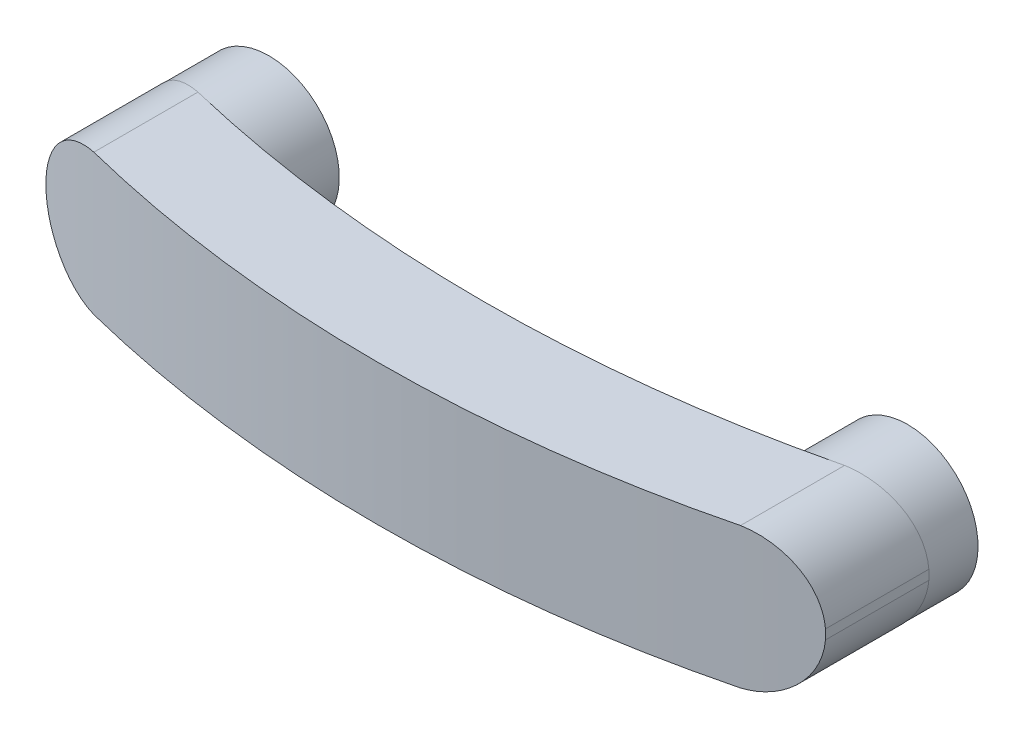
ISO-10303-21;
HEADER;
FILE_DESCRIPTION(('STEP AP214'),'2;1');
FILE_NAME('part.step','',(''),(''),'','','');
FILE_SCHEMA(('AUTOMOTIVE_DESIGN { 1 0 10303 214 1 1 1 1 }'));
ENDSEC;
DATA;
#1=APPLICATION_CONTEXT('core data for automotive mechanical design processes');
#2=APPLICATION_PROTOCOL_DEFINITION('international standard','automotive_design',2000,#1);
#3=PRODUCT_CONTEXT('',#1,'mechanical');
#4=PRODUCT('Part','Part','',(#3));
#5=PRODUCT_RELATED_PRODUCT_CATEGORY('part','',(#4));
#6=PRODUCT_DEFINITION_FORMATION('','',#4);
#7=PRODUCT_DEFINITION_CONTEXT('part definition',#1,'design');
#8=PRODUCT_DEFINITION('design','',#6,#7);
#9=PRODUCT_DEFINITION_SHAPE('','',#8);
#10=(LENGTH_UNIT() NAMED_UNIT(*) SI_UNIT(.MILLI.,.METRE.));
#11=(NAMED_UNIT(*) PLANE_ANGLE_UNIT() SI_UNIT($,.RADIAN.));
#12=(NAMED_UNIT(*) SI_UNIT($,.STERADIAN.) SOLID_ANGLE_UNIT());
#13=UNCERTAINTY_MEASURE_WITH_UNIT(LENGTH_MEASURE(1.E-05),#10,'distance_accuracy_value','');
#14=(GEOMETRIC_REPRESENTATION_CONTEXT(3) GLOBAL_UNCERTAINTY_ASSIGNED_CONTEXT((#13)) GLOBAL_UNIT_ASSIGNED_CONTEXT((#10,
#11,#12)) REPRESENTATION_CONTEXT('',''));
#15=CARTESIAN_POINT('',(0.,0.,0.));
#16=DIRECTION('',(0.,0.,1.));
#17=DIRECTION('',(1.,0.,0.));
#18=AXIS2_PLACEMENT_3D('',#15,#16,#17);
#19=CARTESIAN_POINT('',(58.5,-13.,-234.5));
#20=DIRECTION('',(0.,-1.,0.));
#21=DIRECTION('',(1.,0.,0.));
#22=AXIS2_PLACEMENT_3D('',#19,#20,#21);
#23=PLANE('',#22);
#24=CARTESIAN_POINT('',(58.5,-13.,-206.));
#25=DIRECTION('',(0.,-1.,0.));
#26=DIRECTION('',(1.,0.,0.));
#27=AXIS2_PLACEMENT_3D('',#24,#25,#26);
#28=CIRCLE('',#27,245.);
#29=CARTESIAN_POINT('',(-1.23138755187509,-13.,31.6071575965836));
#30=VERTEX_POINT('',#29);
#31=CARTESIAN_POINT('',(118.231387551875,-13.,31.6071575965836));
#32=VERTEX_POINT('',#31);
#33=EDGE_CURVE('E35',#30,#32,#28,.F.);
#34=ORIENTED_EDGE('',*,*,#33,.F.);
#35=DIRECTION('',(0.,0.,-1.));
#36=VECTOR('',#35,1.);
#37=CARTESIAN_POINT('',(-1.23138755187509,-13.,78.));
#38=LINE('',#37,#36);
#39=CARTESIAN_POINT('',(-1.23138755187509,-13.,12.3768141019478));
#40=VERTEX_POINT('',#39);
#41=EDGE_CURVE('E189',#40,#30,#38,.F.);
#42=ORIENTED_EDGE('',*,*,#41,.F.);
#43=CARTESIAN_POINT('',(58.5,-13.,-234.5));
#44=DIRECTION('',(0.,-1.,0.));
#45=DIRECTION('',(1.,0.,0.));
#46=AXIS2_PLACEMENT_3D('',#43,#44,#45);
#47=CIRCLE('',#46,254.);
#48=CARTESIAN_POINT('',(-0.499999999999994,-13.,12.5526259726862));
#49=VERTEX_POINT('',#48);
#50=EDGE_CURVE('E213',#49,#40,#47,.T.);
#51=ORIENTED_EDGE('',*,*,#50,.F.);
#52=CARTESIAN_POINT('',(117.5,-13.,12.5526259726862));
#53=VERTEX_POINT('',#52);
#54=EDGE_CURVE('E218',#53,#49,#47,.T.);
#55=ORIENTED_EDGE('',*,*,#54,.F.);
#56=CARTESIAN_POINT('',(118.231387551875,-13.,12.3768141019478));
#57=VERTEX_POINT('',#56);
#58=EDGE_CURVE('E220',#57,#53,#47,.T.);
#59=ORIENTED_EDGE('',*,*,#58,.F.);
#60=DIRECTION('',(0.,0.,-1.));
#61=VECTOR('',#60,1.);
#62=CARTESIAN_POINT('',(118.231387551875,-13.,78.));
#63=LINE('',#62,#61);
#64=EDGE_CURVE('E120',#32,#57,#63,.T.);
#65=ORIENTED_EDGE('',*,*,#64,.F.);
#66=EDGE_LOOP('',(#34,#42,#51,#55,#59,#65));
#67=FACE_BOUND('',#66,.T.);
#68=ADVANCED_FACE('F14',(#67),#23,.T.);
#69=CARTESIAN_POINT('',(58.5,13.,-234.5));
#70=DIRECTION('',(0.,-1.,0.));
#71=DIRECTION('',(1.,0.,0.));
#72=AXIS2_PLACEMENT_3D('',#69,#70,#71);
#73=PLANE('',#72);
#74=DIRECTION('',(0.,0.,-1.));
#75=VECTOR('',#74,1.);
#76=CARTESIAN_POINT('',(-1.2313875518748,13.,78.));
#77=LINE('',#76,#75);
#78=CARTESIAN_POINT('',(-1.2313875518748,13.,12.3768141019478));
#79=VERTEX_POINT('',#78);
#80=CARTESIAN_POINT('',(-1.2313875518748,13.,31.6071575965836));
#81=VERTEX_POINT('',#80);
#82=EDGE_CURVE('E301',#79,#81,#77,.F.);
#83=ORIENTED_EDGE('',*,*,#82,.T.);
#84=CARTESIAN_POINT('',(58.5,13.,-206.));
#85=DIRECTION('',(0.,-1.,0.));
#86=DIRECTION('',(1.,0.,0.));
#87=AXIS2_PLACEMENT_3D('',#84,#85,#86);
#88=CIRCLE('',#87,245.);
#89=CARTESIAN_POINT('',(118.231387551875,13.,31.6071575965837));
#90=VERTEX_POINT('',#89);
#91=EDGE_CURVE('E163',#81,#90,#88,.F.);
#92=ORIENTED_EDGE('',*,*,#91,.T.);
#93=DIRECTION('',(0.,0.,-1.));
#94=VECTOR('',#93,1.);
#95=CARTESIAN_POINT('',(118.231387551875,13.,78.));
#96=LINE('',#95,#94);
#97=CARTESIAN_POINT('',(118.231387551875,13.,12.3768141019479));
#98=VERTEX_POINT('',#97);
#99=EDGE_CURVE('E28',#90,#98,#96,.T.);
#100=ORIENTED_EDGE('',*,*,#99,.T.);
#101=CARTESIAN_POINT('',(58.5,13.,-234.5));
#102=DIRECTION('',(0.,-1.,0.));
#103=DIRECTION('',(1.,0.,0.));
#104=AXIS2_PLACEMENT_3D('',#101,#102,#103);
#105=CIRCLE('',#104,254.);
#106=CARTESIAN_POINT('',(117.5,13.,12.5526259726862));
#107=VERTEX_POINT('',#106);
#108=EDGE_CURVE('E205',#98,#107,#105,.T.);
#109=ORIENTED_EDGE('',*,*,#108,.T.);
#110=CARTESIAN_POINT('',(-0.499999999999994,13.,12.5526259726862));
#111=VERTEX_POINT('',#110);
#112=EDGE_CURVE('E214',#107,#111,#105,.T.);
#113=ORIENTED_EDGE('',*,*,#112,.T.);
#114=EDGE_CURVE('E216',#111,#79,#105,.T.);
#115=ORIENTED_EDGE('',*,*,#114,.T.);
#116=EDGE_LOOP('',(#83,#92,#100,#109,#113,#115));
#117=FACE_BOUND('',#116,.T.);
#118=ADVANCED_FACE('F266',(#117),#73,.F.);
#119=CARTESIAN_POINT('',(58.5,-13.,-234.5));
#120=DIRECTION('',(0.,1.,0.));
#121=DIRECTION('',(-1.,0.,0.));
#122=AXIS2_PLACEMENT_3D('',#119,#120,#121);
#123=CYLINDRICAL_SURFACE('',#122,254.);
#124=CARTESIAN_POINT('',(-1.2313875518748,13.,12.3768141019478));
#125=CARTESIAN_POINT('',(-1.60681353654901,12.9791998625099,12.2859893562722));
#126=CARTESIAN_POINT('',(-1.98116401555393,12.9420826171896,12.1945008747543));
#127=CARTESIAN_POINT('',(-2.72510339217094,12.8356797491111,12.0109172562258));
#128=CARTESIAN_POINT('',(-3.0946924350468,12.7663951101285,11.9188221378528));
#129=CARTESIAN_POINT('',(-3.82654768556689,12.5961159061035,11.7347338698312));
#130=CARTESIAN_POINT('',(-4.18881337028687,12.4951190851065,11.6427407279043));
#131=CARTESIAN_POINT('',(-4.90345100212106,12.2621050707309,11.4596275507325));
#132=CARTESIAN_POINT('',(-5.25582305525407,12.130088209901,11.3685075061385));
#133=CARTESIAN_POINT('',(-5.94838944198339,11.8357920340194,11.1878777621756));
#134=CARTESIAN_POINT('',(-6.28857638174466,11.6734947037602,11.0983690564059));
#135=CARTESIAN_POINT('',(-6.95410443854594,11.319714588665,10.9218383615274));
#136=CARTESIAN_POINT('',(-7.2794454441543,11.128231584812,10.8348163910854));
#137=CARTESIAN_POINT('',(-7.91275402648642,10.7173712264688,10.6641361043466));
#138=CARTESIAN_POINT('',(-8.2207285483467,10.4980051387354,10.5804764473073));
#139=CARTESIAN_POINT('',(-8.81710600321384,10.0327176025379,10.4173387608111));
#140=CARTESIAN_POINT('',(-9.10550928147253,9.78679662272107,10.3378606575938));
#141=CARTESIAN_POINT('',(-9.65750568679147,9.27276885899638,10.1847678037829));
#142=CARTESIAN_POINT('',(-9.92133162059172,9.00492814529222,10.111099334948));
#143=CARTESIAN_POINT('',(-10.4254979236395,8.44658353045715,9.9695161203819));
#144=CARTESIAN_POINT('',(-10.6658390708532,8.15608038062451,9.90160118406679));
#145=CARTESIAN_POINT('',(-11.1211516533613,7.55422503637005,9.77228926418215));
#146=CARTESIAN_POINT('',(-11.3361102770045,7.24286243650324,9.71089557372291));
#147=CARTESIAN_POINT('',(-11.7386286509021,6.60163433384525,9.59542991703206));
#148=CARTESIAN_POINT('',(-11.9261903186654,6.27177012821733,9.5413574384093));
#149=CARTESIAN_POINT('',(-12.2664960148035,5.60713406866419,9.44288960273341));
#150=CARTESIAN_POINT('',(-12.4201861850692,5.27288507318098,9.39823340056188));
#151=CARTESIAN_POINT('',(-12.698998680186,4.59174309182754,9.31698811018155));
#152=CARTESIAN_POINT('',(-12.8241231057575,4.24485103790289,9.2803984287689));
#153=CARTESIAN_POINT('',(-13.0444481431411,3.54168267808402,9.21582858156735));
#154=CARTESIAN_POINT('',(-13.1397073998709,3.18542627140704,9.18783154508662));
#155=CARTESIAN_POINT('',(-13.2996987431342,2.46571445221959,9.1407401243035));
#156=CARTESIAN_POINT('',(-13.3644503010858,2.10226378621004,9.12164006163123));
#157=CARTESIAN_POINT('',(-13.4327369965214,1.59491560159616,9.10148133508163));
#158=CARTESIAN_POINT('',(-13.4494789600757,1.45284617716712,9.09653672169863));
#159=CARTESIAN_POINT('',(-13.4782585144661,1.16836327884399,9.08803444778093));
#160=CARTESIAN_POINT('',(-13.4903017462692,1.02595042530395,9.08447512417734));
#161=CARTESIAN_POINT('',(-13.5,0.883345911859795,9.08160850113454));
#162=B_SPLINE_CURVE_WITH_KNOTS('',3,(#124,#125,#126,#127,#128,#129,#130,#131,#132,#133,#134,
#135,#136,#137,#138,#139,#140,#141,#142,#143,#144,#145,#146,#147,#148,#149,#150,#151,#152,#153,
#154,#155,#156,#157,#158,#159,#160,#161),.UNSPECIFIED.,.F.,.F.,(4,2,2,2,2,2,2,2,2,2,2,2,2,2,2,2,
2,2,4),(0.,1.16009012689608,2.32014477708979,3.48028197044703,4.64040672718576,5.80122390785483,
6.96204980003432,8.12240811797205,9.28274596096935,10.4306459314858,11.578507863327,
12.7269467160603,13.8753051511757,14.9856953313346,16.0960038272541,17.2041182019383,
18.3115243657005,18.7408719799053,19.1697025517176),.UNSPECIFIED.);
#163=CARTESIAN_POINT('',(-13.5,0.883345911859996,9.08160850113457));
#164=VERTEX_POINT('',#163);
#165=EDGE_CURVE('E182',#79,#164,#162,.T.);
#166=ORIENTED_EDGE('',*,*,#165,.F.);
#167=ORIENTED_EDGE('',*,*,#114,.F.);
#168=CARTESIAN_POINT('',(-0.499999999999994,13.,12.5526259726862));
#169=CARTESIAN_POINT('',(-0.875668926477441,13.0000019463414,12.4629107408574));
#170=CARTESIAN_POINT('',(-1.2510949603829,12.9837104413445,12.3723451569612));
#171=CARTESIAN_POINT('',(-1.99900156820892,12.9187424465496,12.190127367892));
#172=CARTESIAN_POINT('',(-2.37148126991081,12.8700567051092,12.0984748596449));
#173=CARTESIAN_POINT('',(-3.11118841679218,12.7405987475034,11.9147051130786));
#174=CARTESIAN_POINT('',(-3.47840902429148,12.6597881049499,11.8225874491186));
#175=CARTESIAN_POINT('',(-4.20456484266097,12.466649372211,11.6387369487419));
#176=CARTESIAN_POINT('',(-4.56350009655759,12.3543214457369,11.5470041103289));
#177=CARTESIAN_POINT('',(-5.27045477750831,12.0989245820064,11.364723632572));
#178=CARTESIAN_POINT('',(-5.61847721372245,11.9558642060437,11.2741756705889));
#179=CARTESIAN_POINT('',(-6.30123628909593,11.6398950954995,11.0950413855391));
#180=CARTESIAN_POINT('',(-6.63597267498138,11.4669857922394,11.0064550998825));
#181=CARTESIAN_POINT('',(-7.28962955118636,11.0924647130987,10.8320995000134));
#182=CARTESIAN_POINT('',(-7.60855443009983,10.8908609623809,10.7463294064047));
#183=CARTESIAN_POINT('',(-8.22831009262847,10.4601917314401,10.5784276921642));
#184=CARTESIAN_POINT('',(-8.52914110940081,10.2311266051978,10.4962960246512));
#185=CARTESIAN_POINT('',(-9.10822160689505,9.74881758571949,10.3371252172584));
#186=CARTESIAN_POINT('',(-9.38662328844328,9.49576755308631,10.2600525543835));
#187=CARTESIAN_POINT('',(-9.92114009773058,8.96570042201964,10.111170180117));
#188=CARTESIAN_POINT('',(-10.1772552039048,8.6886833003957,10.0393604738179));
#189=CARTESIAN_POINT('',(-10.6650810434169,8.11255749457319,9.90183265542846));
#190=CARTESIAN_POINT('',(-10.8967935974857,7.81345046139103,9.83611408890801));
#191=CARTESIAN_POINT('',(-11.3338501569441,7.19520589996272,9.71155793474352));
#192=CARTESIAN_POINT('',(-11.5391949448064,6.87606896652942,9.65272014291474));
#193=CARTESIAN_POINT('',(-11.9156863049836,6.23035882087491,9.54439821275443));
#194=CARTESIAN_POINT('',(-12.087703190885,5.90433241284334,9.49467865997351));
#195=CARTESIAN_POINT('',(-12.403778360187,5.23794269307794,9.4030161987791));
#196=CARTESIAN_POINT('',(-12.5478371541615,4.89757964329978,9.3610731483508));
#197=CARTESIAN_POINT('',(-12.8066638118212,4.20507286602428,9.28551615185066));
#198=CARTESIAN_POINT('',(-12.9214376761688,3.85293156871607,9.25190049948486));
#199=CARTESIAN_POINT('',(-13.1206558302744,3.13946092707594,9.19343949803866));
#200=CARTESIAN_POINT('',(-13.2051009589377,2.7781318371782,9.16859390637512));
#201=CARTESIAN_POINT('',(-13.3402752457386,2.06273030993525,9.12877421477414));
#202=CARTESIAN_POINT('',(-13.3921474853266,1.70889204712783,9.11346560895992));
#203=CARTESIAN_POINT('',(-13.4665719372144,0.997882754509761,9.0914900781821));
#204=CARTESIAN_POINT('',(-13.4891249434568,0.640711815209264,9.08482291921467));
#205=CARTESIAN_POINT('',(-13.5047043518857,-0.0742856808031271,9.08021803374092));
#206=CARTESIAN_POINT('',(-13.4977342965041,-0.432112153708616,9.08227925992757));
#207=CARTESIAN_POINT('',(-13.454339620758,-1.14581667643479,9.09510159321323));
#208=CARTESIAN_POINT('',(-13.4179151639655,-1.50169473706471,9.10586265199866));
#209=CARTESIAN_POINT('',(-13.3169001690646,-2.20226586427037,9.13566150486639));
#210=CARTESIAN_POINT('',(-13.2528490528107,-2.54704364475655,9.15454076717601));
#211=CARTESIAN_POINT('',(-13.0972630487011,-3.22979082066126,9.20030465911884));
#212=CARTESIAN_POINT('',(-13.005728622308,-3.56776033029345,9.2271891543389));
#213=CARTESIAN_POINT('',(-12.7959516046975,-4.23458918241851,9.28863635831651));
#214=CARTESIAN_POINT('',(-12.6777086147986,-4.56344838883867,9.32319918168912));
#215=CARTESIAN_POINT('',(-12.415491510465,-5.20986771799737,9.39959347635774));
#216=CARTESIAN_POINT('',(-12.2715170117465,-5.52742767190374,9.4414250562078));
#217=CARTESIAN_POINT('',(-11.9570879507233,-6.15298025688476,9.53242787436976));
#218=CARTESIAN_POINT('',(-11.7863327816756,-6.4608096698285,9.58168214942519));
#219=CARTESIAN_POINT('',(-11.4209915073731,-7.0608303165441,9.68659064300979));
#220=CARTESIAN_POINT('',(-11.2264053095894,-7.35302148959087,9.74224488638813));
#221=CARTESIAN_POINT('',(-10.8148600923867,-7.91999884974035,9.85935817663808));
#222=CARTESIAN_POINT('',(-10.5978989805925,-8.19478340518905,9.92081776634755));
#223=CARTESIAN_POINT('',(-10.1431921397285,-8.7253029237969,10.048907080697));
#224=CARTESIAN_POINT('',(-9.90544523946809,-8.98103681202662,10.1155370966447));
#225=CARTESIAN_POINT('',(-9.40241084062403,-9.48034304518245,10.2556598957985));
#226=CARTESIAN_POINT('',(-9.13646113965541,-9.72320455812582,10.329309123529));
#227=CARTESIAN_POINT('',(-8.58604228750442,-10.1855342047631,10.4807020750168));
#228=CARTESIAN_POINT('',(-8.30157276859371,-10.4050018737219,10.5584458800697));
#229=CARTESIAN_POINT('',(-7.71605441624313,-10.8192972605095,10.7173039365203));
#230=CARTESIAN_POINT('',(-7.41500327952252,-11.014121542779,10.7984186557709));
#231=CARTESIAN_POINT('',(-6.79838569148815,-11.3779831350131,10.9632817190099));
#232=CARTESIAN_POINT('',(-6.48281883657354,-11.5470197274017,11.0470301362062));
#233=CARTESIAN_POINT('',(-5.82797594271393,-11.8637913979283,11.2194133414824));
#234=CARTESIAN_POINT('',(-5.48825664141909,-12.0105736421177,11.3081165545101));
#235=CARTESIAN_POINT('',(-4.79784271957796,-12.2745732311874,11.4868091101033));
#236=CARTESIAN_POINT('',(-4.44714784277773,-12.3917898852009,11.576798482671));
#237=CARTESIAN_POINT('',(-3.73714258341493,-12.5959265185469,11.7573293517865));
#238=CARTESIAN_POINT('',(-3.37783125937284,-12.682843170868,11.8478709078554));
#239=CARTESIAN_POINT('',(-2.65307995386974,-12.8257814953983,12.0287819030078));
#240=CARTESIAN_POINT('',(-2.28764006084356,-12.8818036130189,12.119151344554));
#241=CARTESIAN_POINT('',(-1.54669883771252,-12.963245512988,12.3006117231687));
#242=CARTESIAN_POINT('',(-1.17113318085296,-12.9881146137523,12.3916877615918));
#243=CARTESIAN_POINT('',(-0.418880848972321,-13.0051899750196,12.5722872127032));
#244=CARTESIAN_POINT('',(-0.0421941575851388,-12.9973957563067,12.6618106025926));
#245=CARTESIAN_POINT('',(0.709596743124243,-12.9490831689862,12.8386714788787));
#246=CARTESIAN_POINT('',(1.08470094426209,-12.9085646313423,12.9260089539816));
#247=CARTESIAN_POINT('',(1.83058752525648,-12.7949471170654,13.0979082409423));
#248=CARTESIAN_POINT('',(2.20136994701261,-12.7218484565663,13.1824700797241));
#249=CARTESIAN_POINT('',(2.93385957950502,-12.5439181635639,13.3478247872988));
#250=CARTESIAN_POINT('',(3.2956052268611,-12.4392615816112,13.4286356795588));
#251=CARTESIAN_POINT('',(4.00938877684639,-12.1986578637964,13.5864907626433));
#252=CARTESIAN_POINT('',(4.36142667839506,-12.0627107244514,13.6635349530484));
#253=CARTESIAN_POINT('',(5.05307087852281,-11.7603503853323,13.8134128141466));
#254=CARTESIAN_POINT('',(5.39267807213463,-11.5939393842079,13.8862467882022));
#255=CARTESIAN_POINT('',(6.05682580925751,-11.2317008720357,14.0273199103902));
#256=CARTESIAN_POINT('',(6.38136661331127,-11.0358738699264,14.0955591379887));
#257=CARTESIAN_POINT('',(7.0064519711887,-10.6203200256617,14.2257815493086));
#258=CARTESIAN_POINT('',(7.30734730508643,-10.4011514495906,14.2878627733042));
#259=CARTESIAN_POINT('',(7.88982772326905,-9.93727329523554,14.4070084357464));
#260=CARTESIAN_POINT('',(8.17141302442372,-9.69256400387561,14.4640729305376));
#261=CARTESIAN_POINT('',(8.71300659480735,-9.17930752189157,14.5729443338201));
#262=CARTESIAN_POINT('',(8.9730168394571,-8.91076251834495,14.6247517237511));
#263=CARTESIAN_POINT('',(9.46938394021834,-8.35171273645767,14.7229177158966));
#264=CARTESIAN_POINT('',(9.70574115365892,-8.06120828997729,14.7692764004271));
#265=CARTESIAN_POINT('',(10.1479073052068,-7.46700521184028,14.8554185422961));
#266=CARTESIAN_POINT('',(10.354277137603,-7.16374163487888,14.8953249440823));
#267=CARTESIAN_POINT('',(10.7409113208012,-6.54036895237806,14.9696539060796));
#268=CARTESIAN_POINT('',(10.921176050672,-6.22026009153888,15.0040765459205));
#269=CARTESIAN_POINT('',(11.2541444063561,-5.56551615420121,15.0673413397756));
#270=CARTESIAN_POINT('',(11.4068500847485,-5.23088216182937,15.0961839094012));
#271=CARTESIAN_POINT('',(11.6834832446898,-4.54949820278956,15.1482196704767));
#272=CARTESIAN_POINT('',(11.8074109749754,-4.20274834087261,15.1714129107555));
#273=CARTESIAN_POINT('',(12.0237175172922,-3.50537030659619,15.2117680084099));
#274=CARTESIAN_POINT('',(12.1165741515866,-3.15489555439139,15.2290213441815));
#275=CARTESIAN_POINT('',(12.2727258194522,-2.44719753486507,15.2579737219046));
#276=CARTESIAN_POINT('',(12.3360211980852,-2.08997434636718,15.2696728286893));
#277=CARTESIAN_POINT('',(12.4325471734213,-1.37136702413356,15.2874940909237));
#278=CARTESIAN_POINT('',(12.465779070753,-1.00998307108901,15.2936164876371));
#279=CARTESIAN_POINT('',(12.5019188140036,-0.285650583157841,15.3002739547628));
#280=CARTESIAN_POINT('',(12.5048267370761,0.0772979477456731,15.3008090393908));
#281=CARTESIAN_POINT('',(12.480391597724,0.799306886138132,15.2963086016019));
#282=CARTESIAN_POINT('',(12.4532840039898,1.15837555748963,15.2913164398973));
#283=CARTESIAN_POINT('',(12.3694058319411,1.87290958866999,15.2758396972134));
#284=CARTESIAN_POINT('',(12.3126354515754,2.22837497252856,15.2653551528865));
#285=CARTESIAN_POINT('',(12.1698760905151,2.93317571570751,15.2389134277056));
#286=CARTESIAN_POINT('',(12.0838875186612,3.28251116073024,15.2229563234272));
#287=CARTESIAN_POINT('',(11.8833609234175,3.97259085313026,15.1856010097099));
#288=CARTESIAN_POINT('',(11.7688228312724,4.31333507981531,15.1642027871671));
#289=CARTESIAN_POINT('',(11.5120196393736,4.98401341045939,15.1159986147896));
#290=CARTESIAN_POINT('',(11.3697404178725,5.31394190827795,15.0891899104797));
#291=CARTESIAN_POINT('',(11.0585903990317,5.96051218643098,15.0302340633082));
#292=CARTESIAN_POINT('',(10.8897196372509,6.27715398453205,14.9980869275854));
#293=CARTESIAN_POINT('',(10.5266847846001,6.89496857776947,14.9285371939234));
#294=CARTESIAN_POINT('',(10.3325214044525,7.19614180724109,14.8911347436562));
#295=CARTESIAN_POINT('',(9.92037093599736,7.78099300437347,14.8111784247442));
#296=CARTESIAN_POINT('',(9.70238370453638,8.06467086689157,14.768624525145));
#297=CARTESIAN_POINT('',(9.24226219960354,8.61499067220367,14.6781103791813));
#298=CARTESIAN_POINT('',(8.99993742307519,8.8814662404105,14.6301070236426));
#299=CARTESIAN_POINT('',(8.49454641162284,9.39294394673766,14.5291569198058));
#300=CARTESIAN_POINT('',(8.23148002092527,9.63794592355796,14.4762101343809));
#301=CARTESIAN_POINT('',(7.68648166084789,10.1049660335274,14.3655534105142));
#302=CARTESIAN_POINT('',(7.40454417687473,10.3269773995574,14.3078420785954));
#303=CARTESIAN_POINT('',(6.823939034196,10.7465438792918,14.1879019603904));
#304=CARTESIAN_POINT('',(6.52527144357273,10.9440990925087,14.1256731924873));
#305=CARTESIAN_POINT('',(5.90812710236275,11.3167149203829,13.9958671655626));
#306=CARTESIAN_POINT('',(5.58939940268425,11.4913344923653,13.928216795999));
#307=CARTESIAN_POINT('',(4.93917469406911,11.8129994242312,13.7888409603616));
#308=CARTESIAN_POINT('',(4.60767734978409,11.9600440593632,13.717115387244));
#309=CARTESIAN_POINT('',(3.93460279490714,12.2255898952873,13.5700222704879));
#310=CARTESIAN_POINT('',(3.59303551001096,12.3441182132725,13.4946582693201));
#311=CARTESIAN_POINT('',(2.9020169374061,12.552150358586,13.3406536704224));
#312=CARTESIAN_POINT('',(2.55256755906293,12.6416611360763,13.2620138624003));
#313=CARTESIAN_POINT('',(1.75599440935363,12.8108040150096,13.0809467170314));
#314=CARTESIAN_POINT('',(1.30719451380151,12.8817521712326,12.9776703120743));
#315=CARTESIAN_POINT('',(0.405478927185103,12.9763491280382,12.7675493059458));
#316=CARTESIAN_POINT('',(-0.0474367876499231,12.9999976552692,12.6607046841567));
#317=CARTESIAN_POINT('',(-0.499999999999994,13.,12.5526259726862));
#318=B_SPLINE_CURVE_WITH_KNOTS('',3,(#168,#169,#170,#171,#172,#173,#174,#175,#176,#177,#178,
#179,#180,#181,#182,#183,#184,#185,#186,#187,#188,#189,#190,#191,#192,#193,#194,#195,#196,#197,
#198,#199,#200,#201,#202,#203,#204,#205,#206,#207,#208,#209,#210,#211,#212,#213,#214,#215,#216,
#217,#218,#219,#220,#221,#222,#223,#224,#225,#226,#227,#228,#229,#230,#231,#232,#233,#234,#235,
#236,#237,#238,#239,#240,#241,#242,#243,#244,#245,#246,#247,#248,#249,#250,#251,#252,#253,#254,
#255,#256,#257,#258,#259,#260,#261,#262,#263,#264,#265,#266,#267,#268,#269,#270,#271,#272,#273,
#274,#275,#276,#277,#278,#279,#280,#281,#282,#283,#284,#285,#286,#287,#288,#289,#290,#291,#292,
#293,#294,#295,#296,#297,#298,#299,#300,#301,#302,#303,#304,#305,#306,#307,#308,#309,#310,#311,
#312,#313,#314,#315,#316,#317),.UNSPECIFIED.,.T.,.F.,(4,2,2,2,2,2,2,2,2,2,2,2,2,2,2,2,2,2,2,2,2,
2,2,2,2,2,2,2,2,2,2,2,2,2,2,2,2,2,2,2,2,2,2,2,2,2,2,2,2,2,2,2,2,2,2,2,2,2,2,2,2,2,2,2,2,2,2,2,2,
2,2,2,2,2,4),(0.,1.15829060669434,2.31691215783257,3.47692379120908,4.63692939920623,
5.79661227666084,6.95631725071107,8.11569851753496,9.27506484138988,10.4257512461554,
11.576438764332,12.7270403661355,13.8776078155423,14.9921040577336,16.1065799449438,
17.2208272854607,18.335043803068,19.4075795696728,20.4800862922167,21.5524643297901,
22.6248364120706,23.6771559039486,24.7294577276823,25.7817752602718,26.8341085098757,
27.899233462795,28.9643625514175,30.0295913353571,31.0948801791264,32.1964504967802,
33.2980426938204,34.3997882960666,35.501564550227,36.6419099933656,37.7822820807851,
38.9227793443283,40.06326016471,41.2236287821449,42.3840144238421,43.5444060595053,
44.7047864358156,45.8588450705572,47.0129038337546,48.1668793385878,49.3208348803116,
50.4516408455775,51.5824341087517,52.7131237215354,53.84379625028,54.9494124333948,
56.0550125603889,57.1605303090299,58.2660385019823,59.3536674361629,60.4412836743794,
61.528852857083,62.6164192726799,63.6955139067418,64.7746013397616,65.8536736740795,
66.9327486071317,68.0123742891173,69.0919985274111,70.1715924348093,71.2511928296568,
72.3400228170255,73.4288609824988,74.5180187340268,75.6071720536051,76.7148984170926,
77.8226538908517,78.9293517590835,80.0357843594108,81.4311531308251,82.8265299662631),.UNSPECIFIED.);
#319=CARTESIAN_POINT('',(-13.5,0.,9.08160850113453));
#320=VERTEX_POINT('',#319);
#321=EDGE_CURVE('E240',#111,#320,#318,.T.);
#322=ORIENTED_EDGE('',*,*,#321,.T.);
#323=DIRECTION('',(0.,1.,0.));
#324=VECTOR('',#323,1.);
#325=CARTESIAN_POINT('',(-13.5,-13.,9.08160850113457));
#326=LINE('',#325,#324);
#327=EDGE_CURVE('E298',#320,#164,#326,.T.);
#328=ORIENTED_EDGE('',*,*,#327,.T.);
#329=EDGE_LOOP('',(#166,#167,#322,#328));
#330=FACE_BOUND('',#329,.T.);
#331=ADVANCED_FACE('F269',(#330),#123,.F.);
#332=CARTESIAN_POINT('',(-13.5,-0.88334591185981,9.08160850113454));
#333=CARTESIAN_POINT('',(-13.4878660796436,-1.06178459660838,9.08519486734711));
#334=CARTESIAN_POINT('',(-13.4720572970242,-1.23992876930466,9.08986710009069));
#335=CARTESIAN_POINT('',(-13.4331281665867,-1.59534432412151,9.10136598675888));
#336=CARTESIAN_POINT('',(-13.410007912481,-1.77261571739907,9.10819261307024));
#337=CARTESIAN_POINT('',(-13.3297578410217,-2.30256148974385,9.1318720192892));
#338=CARTESIAN_POINT('',(-13.2617290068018,-2.65350974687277,9.1519272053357));
#339=CARTESIAN_POINT('',(-13.0974020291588,-3.34732675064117,9.20026530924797));
#340=CARTESIAN_POINT('',(-13.0011621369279,-3.6902105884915,9.22853127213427));
#341=CARTESIAN_POINT('',(-12.7811943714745,-4.36629610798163,9.29295406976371));
#342=CARTESIAN_POINT('',(-12.6574660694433,-4.69949763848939,9.32911102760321));
#343=CARTESIAN_POINT('',(-12.3835978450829,-5.35386440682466,9.40886797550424));
#344=CARTESIAN_POINT('',(-12.233462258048,-5.67503160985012,9.45246674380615));
#345=CARTESIAN_POINT('',(-11.907993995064,-6.30327631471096,9.54660018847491));
#346=CARTESIAN_POINT('',(-11.7326606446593,-6.61035343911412,9.59713505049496));
#347=CARTESIAN_POINT('',(-11.3581630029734,-7.20848672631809,9.70457611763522));
#348=CARTESIAN_POINT('',(-11.1589957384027,-7.49954088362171,9.76148311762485));
#349=CARTESIAN_POINT('',(-10.7383610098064,-8.06379986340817,9.88104909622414));
#350=CARTESIAN_POINT('',(-10.5168932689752,-8.33700446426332,9.94370814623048));
#351=CARTESIAN_POINT('',(-10.0481120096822,-8.86980899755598,10.0755852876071));
#352=CARTESIAN_POINT('',(-9.80033308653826,-9.1289710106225,10.1449182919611));
#353=CARTESIAN_POINT('',(-9.28497256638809,-9.62539732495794,10.2882125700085));
#354=CARTESIAN_POINT('',(-9.0173905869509,-9.86266120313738,10.3621739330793));
#355=CARTESIAN_POINT('',(-8.4641721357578,-10.3140221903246,10.5140443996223));
#356=CARTESIAN_POINT('',(-8.17852661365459,-10.528107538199,10.5919554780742));
#357=CARTESIAN_POINT('',(-7.59125556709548,-10.9317509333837,10.7509703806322));
#358=CARTESIAN_POINT('',(-7.28963013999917,-11.1213091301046,10.8320741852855));
#359=CARTESIAN_POINT('',(-6.66084050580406,-11.4814496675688,10.9998465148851));
#360=CARTESIAN_POINT('',(-6.33314308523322,-11.6510575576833,11.0866097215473));
#361=CARTESIAN_POINT('',(-5.6649634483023,-11.9617096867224,11.2620328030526));
#362=CARTESIAN_POINT('',(-5.32448096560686,-12.1027533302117,11.3506927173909));
#363=CARTESIAN_POINT('',(-4.63343765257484,-12.3552762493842,11.5290556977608));
#364=CARTESIAN_POINT('',(-4.28288808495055,-12.4667872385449,11.6187575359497));
#365=CARTESIAN_POINT('',(-3.57384569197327,-12.6597061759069,11.7985411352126));
#366=CARTESIAN_POINT('',(-3.21535638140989,-12.7411271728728,11.8886227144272));
#367=CARTESIAN_POINT('',(-2.58583398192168,-12.8563483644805,12.0453250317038));
#368=CARTESIAN_POINT('',(-2.31605319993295,-12.897012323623,12.1120134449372));
#369=CARTESIAN_POINT('',(-1.77483609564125,-12.9612791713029,12.244851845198));
#370=CARTESIAN_POINT('',(-1.50340343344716,-12.984911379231,12.311002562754));
#371=CARTESIAN_POINT('',(-1.23138755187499,-13.,12.3768141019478));
#372=B_SPLINE_CURVE_WITH_KNOTS('',3,(#332,#333,#334,#335,#336,#337,#338,#339,#340,#341,#342,
#343,#344,#345,#346,#347,#348,#349,#350,#351,#352,#353,#354,#355,#356,#357,#358,#359,#360,#361,
#362,#363,#364,#365,#366,#367,#368,#369,#370,#371),.UNSPECIFIED.,.F.,.F.,(4,2,2,2,2,2,2,2,2,2,2,
2,2,2,2,2,2,2,2,4),(0.,0.536573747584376,1.07314061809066,2.14584784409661,3.21635552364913,
4.28687990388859,5.35722869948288,6.42760614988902,7.49811726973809,8.56864167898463,
9.66298368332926,10.7573468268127,11.8522626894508,12.9471718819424,14.0830177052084,
15.2188872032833,16.3535319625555,17.4876840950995,18.3297663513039,19.1703955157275),.UNSPECIFIED.);
#373=CARTESIAN_POINT('',(-13.5,-0.88334591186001,9.08160850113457));
#374=VERTEX_POINT('',#373);
#375=EDGE_CURVE('E42',#374,#40,#372,.T.);
#376=ORIENTED_EDGE('',*,*,#375,.F.);
#377=EDGE_CURVE('E285',#374,#320,#326,.T.);
#378=ORIENTED_EDGE('',*,*,#377,.T.);
#379=EDGE_CURVE('E244',#320,#49,#318,.T.);
#380=ORIENTED_EDGE('',*,*,#379,.T.);
#381=ORIENTED_EDGE('',*,*,#50,.T.);
#382=EDGE_LOOP('',(#376,#378,#380,#381));
#383=FACE_BOUND('',#382,.T.);
#384=ADVANCED_FACE('F288',(#383),#123,.F.);
#385=EDGE_CURVE('E245',#49,#111,#318,.T.);
#386=ORIENTED_EDGE('',*,*,#385,.T.);
#387=ORIENTED_EDGE('',*,*,#112,.F.);
#388=CARTESIAN_POINT('',(117.5,-13.,12.5526259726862));
#389=CARTESIAN_POINT('',(117.875668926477,-13.0000019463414,12.4629107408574));
#390=CARTESIAN_POINT('',(118.251094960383,-12.9837104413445,12.3723451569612));
#391=CARTESIAN_POINT('',(118.999001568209,-12.9187424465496,12.190127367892));
#392=CARTESIAN_POINT('',(119.371481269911,-12.8700567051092,12.0984748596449));
#393=CARTESIAN_POINT('',(120.111188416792,-12.7405987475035,11.9147051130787));
#394=CARTESIAN_POINT('',(120.478409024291,-12.65978810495,11.8225874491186));
#395=CARTESIAN_POINT('',(121.204564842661,-12.466649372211,11.638736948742));
#396=CARTESIAN_POINT('',(121.563500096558,-12.3543214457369,11.5470041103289));
#397=CARTESIAN_POINT('',(122.270454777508,-12.0989245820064,11.3647236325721));
#398=CARTESIAN_POINT('',(122.618477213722,-11.9558642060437,11.2741756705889));
#399=CARTESIAN_POINT('',(123.301236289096,-11.6398950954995,11.0950413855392));
#400=CARTESIAN_POINT('',(123.635972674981,-11.4669857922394,11.0064550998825));
#401=CARTESIAN_POINT('',(124.289629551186,-11.0924647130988,10.8320995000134));
#402=CARTESIAN_POINT('',(124.6085544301,-10.890860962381,10.7463294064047));
#403=CARTESIAN_POINT('',(125.228310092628,-10.4601917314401,10.5784276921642));
#404=CARTESIAN_POINT('',(125.529141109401,-10.2311266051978,10.4962960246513));
#405=CARTESIAN_POINT('',(126.108221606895,-9.74881758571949,10.3371252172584));
#406=CARTESIAN_POINT('',(126.386623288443,-9.49576755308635,10.2600525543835));
#407=CARTESIAN_POINT('',(126.921140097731,-8.9657004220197,10.111170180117));
#408=CARTESIAN_POINT('',(127.177255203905,-8.68868330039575,10.0393604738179));
#409=CARTESIAN_POINT('',(127.665081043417,-8.11255749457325,9.90183265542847));
#410=CARTESIAN_POINT('',(127.896793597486,-7.81345046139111,9.83611408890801));
#411=CARTESIAN_POINT('',(128.333850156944,-7.19520589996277,9.71155793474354));
#412=CARTESIAN_POINT('',(128.539194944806,-6.87606896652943,9.65272014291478));
#413=CARTESIAN_POINT('',(128.915686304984,-6.2303588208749,9.54439821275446));
#414=CARTESIAN_POINT('',(129.087703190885,-5.90433241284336,9.49467865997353));
#415=CARTESIAN_POINT('',(129.403778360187,-5.23794269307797,9.40301619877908));
#416=CARTESIAN_POINT('',(129.547837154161,-4.89757964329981,9.36107314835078));
#417=CARTESIAN_POINT('',(129.806663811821,-4.2050728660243,9.28551615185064));
#418=CARTESIAN_POINT('',(129.921437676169,-3.85293156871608,9.25190049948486));
#419=CARTESIAN_POINT('',(130.120655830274,-3.13946092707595,9.19343949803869));
#420=CARTESIAN_POINT('',(130.205100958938,-2.77813183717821,9.16859390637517));
#421=CARTESIAN_POINT('',(130.340275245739,-2.06273030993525,9.12877421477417));
#422=CARTESIAN_POINT('',(130.392147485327,-1.70889204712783,9.11346560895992));
#423=CARTESIAN_POINT('',(130.466571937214,-0.997882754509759,9.0914900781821));
#424=CARTESIAN_POINT('',(130.489124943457,-0.640711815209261,9.08482291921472));
#425=CARTESIAN_POINT('',(130.504704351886,0.0742856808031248,9.08021803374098));
#426=CARTESIAN_POINT('',(130.497734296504,0.432112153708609,9.0822792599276));
#427=CARTESIAN_POINT('',(130.454339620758,1.14581667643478,9.09510159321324));
#428=CARTESIAN_POINT('',(130.417915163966,1.50169473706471,9.1058626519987));
#429=CARTESIAN_POINT('',(130.316900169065,2.20226586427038,9.13566150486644));
#430=CARTESIAN_POINT('',(130.252849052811,2.54704364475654,9.15454076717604));
#431=CARTESIAN_POINT('',(130.097263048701,3.22979082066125,9.20030465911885));
#432=CARTESIAN_POINT('',(130.005728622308,3.56776033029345,9.22718915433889));
#433=CARTESIAN_POINT('',(129.795951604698,4.23458918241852,9.28863635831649));
#434=CARTESIAN_POINT('',(129.677708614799,4.56344838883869,9.3231991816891));
#435=CARTESIAN_POINT('',(129.415491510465,5.20986771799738,9.39959347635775));
#436=CARTESIAN_POINT('',(129.271517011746,5.52742767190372,9.44142505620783));
#437=CARTESIAN_POINT('',(128.957087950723,6.15298025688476,9.5324278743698));
#438=CARTESIAN_POINT('',(128.786332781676,6.46080966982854,9.58168214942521));
#439=CARTESIAN_POINT('',(128.420991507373,7.06083031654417,9.68659064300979));
#440=CARTESIAN_POINT('',(128.226405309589,7.35302148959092,9.74224488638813));
#441=CARTESIAN_POINT('',(127.814860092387,7.9199988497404,9.85935817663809));
#442=CARTESIAN_POINT('',(127.597898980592,8.19478340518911,9.92081776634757));
#443=CARTESIAN_POINT('',(127.143192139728,8.72530292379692,10.0489070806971));
#444=CARTESIAN_POINT('',(126.905445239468,8.9810368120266,10.1155370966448));
#445=CARTESIAN_POINT('',(126.402410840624,9.48034304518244,10.2556598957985));
#446=CARTESIAN_POINT('',(126.136461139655,9.72320455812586,10.329309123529));
#447=CARTESIAN_POINT('',(125.586042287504,10.1855342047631,10.4807020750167));
#448=CARTESIAN_POINT('',(125.301572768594,10.405001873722,10.5584458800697));
#449=CARTESIAN_POINT('',(124.716054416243,10.8192972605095,10.7173039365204));
#450=CARTESIAN_POINT('',(124.415003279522,11.014121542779,10.798418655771));
#451=CARTESIAN_POINT('',(123.798385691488,11.3779831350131,10.96328171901));
#452=CARTESIAN_POINT('',(123.482818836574,11.5470197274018,11.0470301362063));
#453=CARTESIAN_POINT('',(122.827975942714,11.8637913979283,11.2194133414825));
#454=CARTESIAN_POINT('',(122.488256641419,12.0105736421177,11.3081165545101));
#455=CARTESIAN_POINT('',(121.797842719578,12.2745732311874,11.4868091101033));
#456=CARTESIAN_POINT('',(121.447147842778,12.3917898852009,11.576798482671));
#457=CARTESIAN_POINT('',(120.737142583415,12.5959265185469,11.7573293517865));
#458=CARTESIAN_POINT('',(120.377831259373,12.682843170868,11.8478709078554));
#459=CARTESIAN_POINT('',(119.65307995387,12.8257814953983,12.0287819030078));
#460=CARTESIAN_POINT('',(119.287640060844,12.8818036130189,12.1191513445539));
#461=CARTESIAN_POINT('',(118.546698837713,12.963245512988,12.3006117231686));
#462=CARTESIAN_POINT('',(118.171133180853,12.9881146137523,12.3916877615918));
#463=CARTESIAN_POINT('',(117.418880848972,13.0051899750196,12.5722872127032));
#464=CARTESIAN_POINT('',(117.042194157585,12.9973957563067,12.6618106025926));
#465=CARTESIAN_POINT('',(116.290403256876,12.9490831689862,12.8386714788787));
#466=CARTESIAN_POINT('',(115.915299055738,12.9085646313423,12.9260089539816));
#467=CARTESIAN_POINT('',(115.169412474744,12.7949471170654,13.0979082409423));
#468=CARTESIAN_POINT('',(114.798630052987,12.7218484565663,13.1824700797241));
#469=CARTESIAN_POINT('',(114.066140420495,12.5439181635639,13.3478247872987));
#470=CARTESIAN_POINT('',(113.704394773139,12.4392615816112,13.4286356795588));
#471=CARTESIAN_POINT('',(112.990611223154,12.1986578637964,13.5864907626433));
#472=CARTESIAN_POINT('',(112.638573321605,12.0627107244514,13.6635349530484));
#473=CARTESIAN_POINT('',(111.946929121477,11.7603503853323,13.8134128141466));
#474=CARTESIAN_POINT('',(111.607321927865,11.5939393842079,13.8862467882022));
#475=CARTESIAN_POINT('',(110.943174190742,11.2317008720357,14.0273199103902));
#476=CARTESIAN_POINT('',(110.618633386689,11.0358738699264,14.0955591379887));
#477=CARTESIAN_POINT('',(109.993548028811,10.6203200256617,14.2257815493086));
#478=CARTESIAN_POINT('',(109.692652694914,10.4011514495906,14.2878627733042));
#479=CARTESIAN_POINT('',(109.110172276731,9.93727329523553,14.4070084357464));
#480=CARTESIAN_POINT('',(108.828586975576,9.6925640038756,14.4640729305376));
#481=CARTESIAN_POINT('',(108.286993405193,9.17930752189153,14.5729443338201));
#482=CARTESIAN_POINT('',(108.026983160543,8.9107625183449,14.6247517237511));
#483=CARTESIAN_POINT('',(107.530616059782,8.35171273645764,14.7229177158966));
#484=CARTESIAN_POINT('',(107.294258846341,8.0612082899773,14.7692764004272));
#485=CARTESIAN_POINT('',(106.852092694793,7.46700521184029,14.8554185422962));
#486=CARTESIAN_POINT('',(106.645722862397,7.16374163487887,14.8953249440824));
#487=CARTESIAN_POINT('',(106.259088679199,6.54036895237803,14.9696539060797));
#488=CARTESIAN_POINT('',(106.078823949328,6.22026009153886,15.0040765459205));
#489=CARTESIAN_POINT('',(105.745855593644,5.56551615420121,15.0673413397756));
#490=CARTESIAN_POINT('',(105.593149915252,5.23088216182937,15.0961839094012));
#491=CARTESIAN_POINT('',(105.31651675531,4.54949820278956,15.1482196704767));
#492=CARTESIAN_POINT('',(105.192589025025,4.20274834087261,15.1714129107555));
#493=CARTESIAN_POINT('',(104.976282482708,3.5053703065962,15.21176800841));
#494=CARTESIAN_POINT('',(104.883425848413,3.15489555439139,15.2290213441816));
#495=CARTESIAN_POINT('',(104.727274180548,2.44719753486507,15.2579737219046));
#496=CARTESIAN_POINT('',(104.663978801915,2.08997434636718,15.2696728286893));
#497=CARTESIAN_POINT('',(104.567452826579,1.37136702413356,15.2874940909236));
#498=CARTESIAN_POINT('',(104.534220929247,1.00998307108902,15.2936164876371));
#499=CARTESIAN_POINT('',(104.498081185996,0.285650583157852,15.3002739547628));
#500=CARTESIAN_POINT('',(104.495173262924,-0.0772979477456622,15.3008090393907));
#501=CARTESIAN_POINT('',(104.519608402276,-0.799306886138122,15.2963086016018));
#502=CARTESIAN_POINT('',(104.54671599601,-1.15837555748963,15.2913164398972));
#503=CARTESIAN_POINT('',(104.630594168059,-1.87290958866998,15.2758396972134));
#504=CARTESIAN_POINT('',(104.687364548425,-2.22837497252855,15.2653551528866));
#505=CARTESIAN_POINT('',(104.830123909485,-2.93317571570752,15.2389134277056));
#506=CARTESIAN_POINT('',(104.916112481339,-3.28251116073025,15.2229563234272));
#507=CARTESIAN_POINT('',(105.116639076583,-3.97259085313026,15.1856010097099));
#508=CARTESIAN_POINT('',(105.231177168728,-4.3133350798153,15.1642027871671));
#509=CARTESIAN_POINT('',(105.487980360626,-4.98401341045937,15.1159986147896));
#510=CARTESIAN_POINT('',(105.630259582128,-5.31394190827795,15.0891899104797));
#511=CARTESIAN_POINT('',(105.941409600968,-5.96051218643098,15.0302340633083));
#512=CARTESIAN_POINT('',(106.110280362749,-6.27715398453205,14.9980869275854));
#513=CARTESIAN_POINT('',(106.4733152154,-6.89496857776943,14.9285371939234));
#514=CARTESIAN_POINT('',(106.667478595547,-7.19614180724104,14.8911347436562));
#515=CARTESIAN_POINT('',(107.079629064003,-7.78099300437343,14.8111784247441));
#516=CARTESIAN_POINT('',(107.297616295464,-8.06467086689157,14.768624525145));
#517=CARTESIAN_POINT('',(107.757737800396,-8.61499067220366,14.6781103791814));
#518=CARTESIAN_POINT('',(108.000062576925,-8.88146624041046,14.6301070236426));
#519=CARTESIAN_POINT('',(108.505453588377,-9.39294394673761,14.5291569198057));
#520=CARTESIAN_POINT('',(108.768519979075,-9.63794592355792,14.4762101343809));
#521=CARTESIAN_POINT('',(109.313518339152,-10.1049660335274,14.3655534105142));
#522=CARTESIAN_POINT('',(109.595455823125,-10.3269773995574,14.3078420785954));
#523=CARTESIAN_POINT('',(110.176060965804,-10.7465438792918,14.1879019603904));
#524=CARTESIAN_POINT('',(110.474728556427,-10.9440990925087,14.1256731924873));
#525=CARTESIAN_POINT('',(111.091872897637,-11.3167149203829,13.9958671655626));
#526=CARTESIAN_POINT('',(111.410600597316,-11.4913344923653,13.928216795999));
#527=CARTESIAN_POINT('',(112.060825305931,-11.8129994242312,13.7888409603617));
#528=CARTESIAN_POINT('',(112.392322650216,-11.9600440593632,13.7171153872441));
#529=CARTESIAN_POINT('',(113.065397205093,-12.2255898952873,13.5700222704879));
#530=CARTESIAN_POINT('',(113.406964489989,-12.3441182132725,13.49465826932));
#531=CARTESIAN_POINT('',(114.097983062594,-12.552150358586,13.3406536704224));
#532=CARTESIAN_POINT('',(114.447432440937,-12.6416611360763,13.2620138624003));
#533=CARTESIAN_POINT('',(115.244005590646,-12.8108040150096,13.0809467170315));
#534=CARTESIAN_POINT('',(115.692805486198,-12.8817521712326,12.9776703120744));
#535=CARTESIAN_POINT('',(116.594521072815,-12.9763491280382,12.7675493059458));
#536=CARTESIAN_POINT('',(117.04743678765,-12.9999976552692,12.6607046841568));
#537=CARTESIAN_POINT('',(117.5,-13.,12.5526259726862));
#538=B_SPLINE_CURVE_WITH_KNOTS('',3,(#388,#389,#390,#391,#392,#393,#394,#395,#396,#397,#398,
#399,#400,#401,#402,#403,#404,#405,#406,#407,#408,#409,#410,#411,#412,#413,#414,#415,#416,#417,
#418,#419,#420,#421,#422,#423,#424,#425,#426,#427,#428,#429,#430,#431,#432,#433,#434,#435,#436,
#437,#438,#439,#440,#441,#442,#443,#444,#445,#446,#447,#448,#449,#450,#451,#452,#453,#454,#455,
#456,#457,#458,#459,#460,#461,#462,#463,#464,#465,#466,#467,#468,#469,#470,#471,#472,#473,#474,
#475,#476,#477,#478,#479,#480,#481,#482,#483,#484,#485,#486,#487,#488,#489,#490,#491,#492,#493,
#494,#495,#496,#497,#498,#499,#500,#501,#502,#503,#504,#505,#506,#507,#508,#509,#510,#511,#512,
#513,#514,#515,#516,#517,#518,#519,#520,#521,#522,#523,#524,#525,#526,#527,#528,#529,#530,#531,
#532,#533,#534,#535,#536,#537),.UNSPECIFIED.,.T.,.F.,(4,2,2,2,2,2,2,2,2,2,2,2,2,2,2,2,2,2,2,2,2,
2,2,2,2,2,2,2,2,2,2,2,2,2,2,2,2,2,2,2,2,2,2,2,2,2,2,2,2,2,2,2,2,2,2,2,2,2,2,2,2,2,2,2,2,2,2,2,2,
2,2,2,2,2,4),(0.,1.15829060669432,2.31691215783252,3.47692379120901,4.63692939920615,
5.79661227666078,6.956317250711,8.11569851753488,9.27506484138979,10.4257512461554,
11.5764387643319,12.7270403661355,13.8776078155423,14.9921040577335,16.1065799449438,
17.2208272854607,18.335043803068,19.4075795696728,20.4800862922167,21.5524643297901,
22.6248364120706,23.6771559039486,24.7294577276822,25.7817752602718,26.8341085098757,
27.8992334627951,28.9643625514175,30.0295913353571,31.0948801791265,32.1964504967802,
33.2980426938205,34.3997882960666,35.501564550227,36.6419099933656,37.782282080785,
38.9227793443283,40.0632601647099,41.2236287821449,42.3840144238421,43.5444060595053,
44.7047864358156,45.8588450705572,47.0129038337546,48.1668793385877,49.3208348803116,
50.4516408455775,51.5824341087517,52.7131237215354,53.8437962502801,54.9494124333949,
56.0550125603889,57.1605303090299,58.2660385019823,59.3536674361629,60.4412836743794,
61.528852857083,62.6164192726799,63.6955139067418,64.7746013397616,65.8536736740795,
66.9327486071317,68.0123742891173,69.091998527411,70.1715924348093,71.2511928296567,
72.3400228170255,73.4288609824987,74.5180187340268,75.6071720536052,76.7148984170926,
77.8226538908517,78.9293517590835,80.0357843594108,81.4311531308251,82.8265299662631),.UNSPECIFIED.);
#539=EDGE_CURVE('E227',#107,#53,#538,.T.);
#540=ORIENTED_EDGE('',*,*,#539,.T.);
#541=ORIENTED_EDGE('',*,*,#54,.T.);
#542=EDGE_LOOP('',(#386,#387,#540,#541));
#543=FACE_BOUND('',#542,.T.);
#544=ADVANCED_FACE('F281',(#543),#123,.F.);
#545=CARTESIAN_POINT('',(118.231387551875,-13.,12.3768141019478));
#546=CARTESIAN_POINT('',(118.606813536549,-12.9791998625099,12.2859893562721));
#547=CARTESIAN_POINT('',(118.981164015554,-12.9420826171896,12.1945008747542));
#548=CARTESIAN_POINT('',(119.725103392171,-12.8356797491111,12.0109172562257));
#549=CARTESIAN_POINT('',(120.094692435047,-12.7663951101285,11.9188221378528));
#550=CARTESIAN_POINT('',(120.826547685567,-12.5961159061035,11.7347338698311));
#551=CARTESIAN_POINT('',(121.188813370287,-12.4951190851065,11.6427407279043));
#552=CARTESIAN_POINT('',(121.903451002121,-12.2621050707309,11.4596275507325));
#553=CARTESIAN_POINT('',(122.255823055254,-12.130088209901,11.3685075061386));
#554=CARTESIAN_POINT('',(122.948389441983,-11.8357920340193,11.1878777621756));
#555=CARTESIAN_POINT('',(123.288576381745,-11.6734947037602,11.0983690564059));
#556=CARTESIAN_POINT('',(123.954104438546,-11.3197145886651,10.9218383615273));
#557=CARTESIAN_POINT('',(124.279445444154,-11.128231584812,10.8348163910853));
#558=CARTESIAN_POINT('',(124.912754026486,-10.7173712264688,10.6641361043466));
#559=CARTESIAN_POINT('',(125.220728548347,-10.4980051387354,10.5804764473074));
#560=CARTESIAN_POINT('',(125.817106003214,-10.0327176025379,10.4173387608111));
#561=CARTESIAN_POINT('',(126.105509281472,-9.786796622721,10.3378606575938));
#562=CARTESIAN_POINT('',(126.657505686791,-9.27276885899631,10.1847678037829));
#563=CARTESIAN_POINT('',(126.921331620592,-9.0049281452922,10.1110993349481));
#564=CARTESIAN_POINT('',(127.42549792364,-8.44658353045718,9.96951612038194));
#565=CARTESIAN_POINT('',(127.665839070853,-8.15608038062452,9.90160118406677));
#566=CARTESIAN_POINT('',(128.121151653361,-7.55422503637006,9.77228926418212));
#567=CARTESIAN_POINT('',(128.336110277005,-7.24286243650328,9.71089557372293));
#568=CARTESIAN_POINT('',(128.738628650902,-6.60163433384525,9.59542991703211));
#569=CARTESIAN_POINT('',(128.926190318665,-6.27177012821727,9.54135743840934));
#570=CARTESIAN_POINT('',(129.266496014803,-5.60713406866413,9.44288960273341));
#571=CARTESIAN_POINT('',(129.420186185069,-5.27288507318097,9.39823340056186));
#572=CARTESIAN_POINT('',(129.698998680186,-4.59174309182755,9.31698811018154));
#573=CARTESIAN_POINT('',(129.824123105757,-4.24485103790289,9.28039842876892));
#574=CARTESIAN_POINT('',(130.044448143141,-3.54168267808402,9.21582858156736));
#575=CARTESIAN_POINT('',(130.139707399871,-3.18542627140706,9.18783154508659));
#576=CARTESIAN_POINT('',(130.299698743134,-2.46571445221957,9.1407401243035));
#577=CARTESIAN_POINT('',(130.364450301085,-2.10226378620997,9.12164006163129));
#578=CARTESIAN_POINT('',(130.432736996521,-1.59491560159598,9.10148133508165));
#579=CARTESIAN_POINT('',(130.449478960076,-1.45284617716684,9.09653672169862));
#580=CARTESIAN_POINT('',(130.478258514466,-1.1683632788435,9.08803444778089));
#581=CARTESIAN_POINT('',(130.490301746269,-1.02595042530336,9.08447512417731));
#582=CARTESIAN_POINT('',(130.5,-0.883345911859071,9.08160850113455));
#583=B_SPLINE_CURVE_WITH_KNOTS('',3,(#545,#546,#547,#548,#549,#550,#551,#552,#553,#554,#555,
#556,#557,#558,#559,#560,#561,#562,#563,#564,#565,#566,#567,#568,#569,#570,#571,#572,#573,#574,
#575,#576,#577,#578,#579,#580,#581,#582),.UNSPECIFIED.,.F.,.F.,(4,2,2,2,2,2,2,2,2,2,2,2,2,2,2,2,
2,2,4),(0.,1.16009012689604,2.32014477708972,3.48028197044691,4.64040672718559,5.80122390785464,
6.96204980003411,8.12240811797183,9.28274596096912,10.4306459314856,11.5785078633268,
12.72694671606,13.8753051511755,14.9856953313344,16.0960038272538,17.2041182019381,
18.3115243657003,18.7408719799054,19.169702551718),.UNSPECIFIED.);
#584=CARTESIAN_POINT('',(130.5,-0.883345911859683,9.08160850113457));
#585=VERTEX_POINT('',#584);
#586=EDGE_CURVE('E118',#57,#585,#583,.T.);
#587=ORIENTED_EDGE('',*,*,#586,.F.);
#588=ORIENTED_EDGE('',*,*,#58,.T.);
#589=CARTESIAN_POINT('',(130.5,0.,9.08160850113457));
#590=VERTEX_POINT('',#589);
#591=EDGE_CURVE('E225',#53,#590,#538,.T.);
#592=ORIENTED_EDGE('',*,*,#591,.T.);
#593=DIRECTION('',(0.,1.,0.));
#594=VECTOR('',#593,1.);
#595=CARTESIAN_POINT('',(130.5,-13.,9.08160850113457));
#596=LINE('',#595,#594);
#597=EDGE_CURVE('E297',#585,#590,#596,.T.);
#598=ORIENTED_EDGE('',*,*,#597,.F.);
#599=EDGE_LOOP('',(#587,#588,#592,#598));
#600=FACE_BOUND('',#599,.T.);
#601=ADVANCED_FACE('F133',(#600),#123,.F.);
#602=CARTESIAN_POINT('',(130.5,0.883345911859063,9.08160850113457));
#603=CARTESIAN_POINT('',(130.487866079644,1.06178459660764,9.08519486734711));
#604=CARTESIAN_POINT('',(130.472057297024,1.23992876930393,9.08986710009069));
#605=CARTESIAN_POINT('',(130.433128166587,1.59534432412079,9.10136598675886));
#606=CARTESIAN_POINT('',(130.410007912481,1.77261571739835,9.10819261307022));
#607=CARTESIAN_POINT('',(130.329757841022,2.30256148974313,9.13187201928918));
#608=CARTESIAN_POINT('',(130.261729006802,2.65350974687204,9.15192720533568));
#609=CARTESIAN_POINT('',(130.097402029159,3.34732675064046,9.20026530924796));
#610=CARTESIAN_POINT('',(130.001162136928,3.69021058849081,9.22853127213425));
#611=CARTESIAN_POINT('',(129.781194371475,4.36629610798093,9.29295406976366));
#612=CARTESIAN_POINT('',(129.657466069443,4.69949763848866,9.32911102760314));
#613=CARTESIAN_POINT('',(129.383597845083,5.35386440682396,9.40886797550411));
#614=CARTESIAN_POINT('',(129.233462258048,5.67503160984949,9.452466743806));
#615=CARTESIAN_POINT('',(128.907993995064,6.30327631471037,9.54660018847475));
#616=CARTESIAN_POINT('',(128.73266064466,6.61035343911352,9.59713505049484));
#617=CARTESIAN_POINT('',(128.358163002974,7.20848672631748,9.7045761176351));
#618=CARTESIAN_POINT('',(128.158995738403,7.4995408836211,9.7614831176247));
#619=CARTESIAN_POINT('',(127.738361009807,8.06379986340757,9.88104909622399));
#620=CARTESIAN_POINT('',(127.516893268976,8.33700446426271,9.94370814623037));
#621=CARTESIAN_POINT('',(127.048112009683,8.86980899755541,10.075585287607));
#622=CARTESIAN_POINT('',(126.800333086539,9.12897101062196,10.144918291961));
#623=CARTESIAN_POINT('',(126.284972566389,9.62539732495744,10.2882125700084));
#624=CARTESIAN_POINT('',(126.017390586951,9.8626612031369,10.3621739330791));
#625=CARTESIAN_POINT('',(125.464172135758,10.3140221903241,10.5140443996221));
#626=CARTESIAN_POINT('',(125.178526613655,10.5281075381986,10.591955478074));
#627=CARTESIAN_POINT('',(124.591255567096,10.9317509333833,10.7509703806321));
#628=CARTESIAN_POINT('',(124.28963014,11.1213091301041,10.8320741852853));
#629=CARTESIAN_POINT('',(123.660840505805,11.4814496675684,10.9998465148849));
#630=CARTESIAN_POINT('',(123.333143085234,11.651057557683,11.0866097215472));
#631=CARTESIAN_POINT('',(122.664963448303,11.9617096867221,11.2620328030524));
#632=CARTESIAN_POINT('',(122.324480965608,12.1027533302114,11.3506927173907));
#633=CARTESIAN_POINT('',(121.633437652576,12.3552762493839,11.5290556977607));
#634=CARTESIAN_POINT('',(121.282888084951,12.4667872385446,11.6187575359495));
#635=CARTESIAN_POINT('',(120.573845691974,12.6597061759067,11.7985411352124));
#636=CARTESIAN_POINT('',(120.215356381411,12.7411271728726,11.888622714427));
#637=CARTESIAN_POINT('',(119.585833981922,12.8563483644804,12.0453250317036));
#638=CARTESIAN_POINT('',(119.316053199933,12.897012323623,12.1120134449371));
#639=CARTESIAN_POINT('',(118.774836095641,12.9612791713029,12.244851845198));
#640=CARTESIAN_POINT('',(118.503403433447,12.984911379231,12.311002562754));
#641=CARTESIAN_POINT('',(118.231387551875,13.,12.3768141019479));
#642=B_SPLINE_CURVE_WITH_KNOTS('',3,(#602,#603,#604,#605,#606,#607,#608,#609,#610,#611,#612,
#613,#614,#615,#616,#617,#618,#619,#620,#621,#622,#623,#624,#625,#626,#627,#628,#629,#630,#631,
#632,#633,#634,#635,#636,#637,#638,#639,#640,#641),.UNSPECIFIED.,.F.,.F.,(4,2,2,2,2,2,2,2,2,2,2,
2,2,2,2,2,2,2,2,4),(0.,0.536573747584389,1.07314061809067,2.14584784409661,3.21635552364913,
4.28687990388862,5.35722869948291,6.42760614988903,7.49811726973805,8.56864167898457,
9.66298368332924,10.7573468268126,11.8522626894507,12.9471718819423,14.0830177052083,
15.2188872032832,16.3535319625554,17.4876840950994,18.3297663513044,19.1703955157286),.UNSPECIFIED.);
#643=CARTESIAN_POINT('',(130.5,0.883345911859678,9.08160850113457));
#644=VERTEX_POINT('',#643);
#645=EDGE_CURVE('E124',#644,#98,#642,.T.);
#646=ORIENTED_EDGE('',*,*,#645,.F.);
#647=EDGE_CURVE('E294',#590,#644,#596,.T.);
#648=ORIENTED_EDGE('',*,*,#647,.F.);
#649=EDGE_CURVE('E208',#590,#107,#538,.T.);
#650=ORIENTED_EDGE('',*,*,#649,.T.);
#651=ORIENTED_EDGE('',*,*,#108,.F.);
#652=EDGE_LOOP('',(#646,#648,#650,#651));
#653=FACE_BOUND('',#652,.T.);
#654=ADVANCED_FACE('F206',(#653),#123,.F.);
#655=CARTESIAN_POINT('',(-13.5,-13.,54.));
#656=DIRECTION('',(1.,0.,0.));
#657=DIRECTION('',(0.,1.,0.));
#658=AXIS2_PLACEMENT_3D('',#655,#656,#657);
#659=PLANE('',#658);
#660=DIRECTION('',(0.,0.,-1.));
#661=VECTOR('',#660,1.);
#662=CARTESIAN_POINT('',(-13.5,-0.88334591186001,78.));
#663=LINE('',#662,#661);
#664=CARTESIAN_POINT('',(-13.5,-0.883345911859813,28.1815535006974));
#665=VERTEX_POINT('',#664);
#666=EDGE_CURVE('E191',#374,#665,#663,.F.);
#667=ORIENTED_EDGE('',*,*,#666,.T.);
#668=DIRECTION('',(0.,1.,0.));
#669=VECTOR('',#668,1.);
#670=CARTESIAN_POINT('',(-13.5,-78.,28.1815535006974));
#671=LINE('',#670,#669);
#672=CARTESIAN_POINT('',(-13.5,0.883345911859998,28.1815535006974));
#673=VERTEX_POINT('',#672);
#674=EDGE_CURVE('E170',#665,#673,#671,.T.);
#675=ORIENTED_EDGE('',*,*,#674,.T.);
#676=DIRECTION('',(0.,0.,-1.));
#677=VECTOR('',#676,1.);
#678=CARTESIAN_POINT('',(-13.5,0.883345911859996,78.));
#679=LINE('',#678,#677);
#680=EDGE_CURVE('E180',#673,#164,#679,.T.);
#681=ORIENTED_EDGE('',*,*,#680,.T.);
#682=ORIENTED_EDGE('',*,*,#327,.F.);
#683=ORIENTED_EDGE('',*,*,#377,.F.);
#684=EDGE_LOOP('',(#667,#675,#681,#682,#683));
#685=FACE_BOUND('',#684,.T.);
#686=ADVANCED_FACE('F16',(#685),#659,.F.);
#687=CARTESIAN_POINT('',(130.5,-13.,9.08160850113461));
#688=DIRECTION('',(-1.,0.,0.));
#689=DIRECTION('',(0.,-1.,0.));
#690=AXIS2_PLACEMENT_3D('',#687,#688,#689);
#691=PLANE('',#690);
#692=DIRECTION('',(0.,0.,-1.));
#693=VECTOR('',#692,1.);
#694=CARTESIAN_POINT('',(130.5,0.883345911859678,78.));
#695=LINE('',#694,#693);
#696=CARTESIAN_POINT('',(130.5,0.883345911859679,28.1815535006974));
#697=VERTEX_POINT('',#696);
#698=EDGE_CURVE('E113',#644,#697,#695,.F.);
#699=ORIENTED_EDGE('',*,*,#698,.T.);
#700=DIRECTION('',(0.,1.,0.));
#701=VECTOR('',#700,1.);
#702=CARTESIAN_POINT('',(130.5,-78.,28.1815535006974));
#703=LINE('',#702,#701);
#704=CARTESIAN_POINT('',(130.5,-0.883345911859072,28.1815535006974));
#705=VERTEX_POINT('',#704);
#706=EDGE_CURVE('E102',#697,#705,#703,.F.);
#707=ORIENTED_EDGE('',*,*,#706,.T.);
#708=DIRECTION('',(0.,0.,-1.));
#709=VECTOR('',#708,1.);
#710=CARTESIAN_POINT('',(130.5,-0.883345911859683,78.));
#711=LINE('',#710,#709);
#712=EDGE_CURVE('E110',#705,#585,#711,.T.);
#713=ORIENTED_EDGE('',*,*,#712,.T.);
#714=ORIENTED_EDGE('',*,*,#597,.T.);
#715=ORIENTED_EDGE('',*,*,#647,.T.);
#716=EDGE_LOOP('',(#699,#707,#713,#714,#715));
#717=FACE_BOUND('',#716,.T.);
#718=ADVANCED_FACE('F109',(#717),#691,.F.);
#719=CARTESIAN_POINT('',(117.5,0.,0.));
#720=DIRECTION('',(0.,0.,-1.));
#721=DIRECTION('',(0.,1.,0.));
#722=AXIS2_PLACEMENT_3D('',#719,#720,#721);
#723=CYLINDRICAL_SURFACE('',#722,13.);
#724=CARTESIAN_POINT('',(117.5,0.,0.));
#725=DIRECTION('',(0.,0.,-1.));
#726=DIRECTION('',(0.,1.,0.));
#727=AXIS2_PLACEMENT_3D('',#724,#725,#726);
#728=CIRCLE('',#727,13.);
#729=CARTESIAN_POINT('',(117.5,13.,0.));
#730=VERTEX_POINT('',#729);
#731=EDGE_CURVE('E235',#730,#730,#728,.T.);
#732=ORIENTED_EDGE('',*,*,#731,.F.);
#733=EDGE_LOOP('',(#732));
#734=FACE_BOUND('',#733,.T.);
#735=ORIENTED_EDGE('',*,*,#649,.F.);
#736=ORIENTED_EDGE('',*,*,#591,.F.);
#737=ORIENTED_EDGE('',*,*,#539,.F.);
#738=EDGE_LOOP('',(#735,#736,#737));
#739=FACE_BOUND('',#738,.T.);
#740=ADVANCED_FACE('F258',(#734,#739),#723,.T.);
#741=CARTESIAN_POINT('',(130.5,0.,0.));
#742=DIRECTION('',(0.,0.,1.));
#743=DIRECTION('',(0.,-1.,0.));
#744=AXIS2_PLACEMENT_3D('',#741,#742,#743);
#745=PLANE('',#744);
#746=CARTESIAN_POINT('',(117.,0.,0.));
#747=DIRECTION('',(0.,0.,-1.));
#748=DIRECTION('',(-1.,0.,0.));
#749=AXIS2_PLACEMENT_3D('',#746,#747,#748);
#750=CIRCLE('',#749,8.);
#751=CARTESIAN_POINT('',(109.,0.,0.));
#752=VERTEX_POINT('',#751);
#753=EDGE_CURVE('E321',#752,#752,#750,.T.);
#754=ORIENTED_EDGE('',*,*,#753,.F.);
#755=EDGE_LOOP('',(#754));
#756=FACE_BOUND('',#755,.T.);
#757=ORIENTED_EDGE('',*,*,#731,.T.);
#758=EDGE_LOOP('',(#757));
#759=FACE_BOUND('',#758,.T.);
#760=ADVANCED_FACE('F255',(#756,#759),#745,.F.);
#761=CARTESIAN_POINT('',(-0.499999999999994,0.,0.));
#762=DIRECTION('',(0.,0.,-1.));
#763=DIRECTION('',(0.,1.,0.));
#764=AXIS2_PLACEMENT_3D('',#761,#762,#763);
#765=CYLINDRICAL_SURFACE('',#764,13.);
#766=CARTESIAN_POINT('',(-0.499999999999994,0.,0.));
#767=DIRECTION('',(0.,0.,-1.));
#768=DIRECTION('',(0.,1.,0.));
#769=AXIS2_PLACEMENT_3D('',#766,#767,#768);
#770=CIRCLE('',#769,13.);
#771=CARTESIAN_POINT('',(-0.499999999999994,13.,0.));
#772=VERTEX_POINT('',#771);
#773=EDGE_CURVE('E122',#772,#772,#770,.T.);
#774=ORIENTED_EDGE('',*,*,#773,.F.);
#775=EDGE_LOOP('',(#774));
#776=FACE_BOUND('',#775,.T.);
#777=ORIENTED_EDGE('',*,*,#321,.F.);
#778=ORIENTED_EDGE('',*,*,#385,.F.);
#779=ORIENTED_EDGE('',*,*,#379,.F.);
#780=EDGE_LOOP('',(#777,#778,#779));
#781=FACE_BOUND('',#780,.T.);
#782=ADVANCED_FACE('F250',(#776,#781),#765,.T.);
#783=CARTESIAN_POINT('',(12.5,0.,0.));
#784=DIRECTION('',(0.,0.,1.));
#785=DIRECTION('',(0.,-1.,0.));
#786=AXIS2_PLACEMENT_3D('',#783,#784,#785);
#787=PLANE('',#786);
#788=CARTESIAN_POINT('',(0.,0.,0.));
#789=DIRECTION('',(0.,0.,-1.));
#790=DIRECTION('',(0.,1.,0.));
#791=AXIS2_PLACEMENT_3D('',#788,#789,#790);
#792=CIRCLE('',#791,3.);
#793=CARTESIAN_POINT('',(0.,3.,0.));
#794=VERTEX_POINT('',#793);
#795=EDGE_CURVE('E318',#794,#794,#792,.T.);
#796=ORIENTED_EDGE('',*,*,#795,.F.);
#797=EDGE_LOOP('',(#796));
#798=FACE_BOUND('',#797,.T.);
#799=ORIENTED_EDGE('',*,*,#773,.T.);
#800=EDGE_LOOP('',(#799));
#801=FACE_BOUND('',#800,.T.);
#802=ADVANCED_FACE('F254',(#798,#801),#787,.F.);
#803=CARTESIAN_POINT('',(-0.51,0.,78.));
#804=DIRECTION('',(0.,0.,-1.));
#805=DIRECTION('',(0.,1.,0.));
#806=AXIS2_PLACEMENT_3D('',#803,#804,#805);
#807=CYLINDRICAL_SURFACE('',#806,13.02);
#808=ORIENTED_EDGE('',*,*,#680,.F.);
#809=CARTESIAN_POINT('',(-13.5,0.883345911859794,28.1815535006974));
#810=CARTESIAN_POINT('',(-13.4878879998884,1.06146272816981,28.1852770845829));
#811=CARTESIAN_POINT('',(-13.4721144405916,1.23928419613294,28.1901260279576));
#812=CARTESIAN_POINT('',(-13.4332830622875,1.59405237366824,28.2020564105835));
#813=CARTESIAN_POINT('',(-13.4102253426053,1.77099909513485,28.2091378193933));
#814=CARTESIAN_POINT('',(-13.330205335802,2.29996454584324,28.2336969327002));
#815=CARTESIAN_POINT('',(-13.2623862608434,2.65025423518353,28.2544925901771));
#816=CARTESIAN_POINT('',(-13.0986068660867,3.34271395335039,28.3046025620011));
#817=CARTESIAN_POINT('',(-13.0027074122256,3.68489983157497,28.3338984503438));
#818=CARTESIAN_POINT('',(-12.7835549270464,4.35959205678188,28.4006568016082));
#819=CARTESIAN_POINT('',(-12.6603014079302,4.69209823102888,28.4381194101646));
#820=CARTESIAN_POINT('',(-12.3875331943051,5.34507090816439,28.5207409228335));
#821=CARTESIAN_POINT('',(-12.2380241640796,5.66553998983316,28.5658981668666));
#822=CARTESIAN_POINT('',(-11.9139620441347,6.29242029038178,28.6633813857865));
#823=CARTESIAN_POINT('',(-11.7394082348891,6.59883110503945,28.7157075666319));
#824=CARTESIAN_POINT('',(-11.3666217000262,7.19569250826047,28.8269426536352));
#825=CARTESIAN_POINT('',(-11.168385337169,7.48614063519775,28.8858525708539));
#826=CARTESIAN_POINT('',(-10.7497683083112,8.04926326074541,29.0096108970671));
#827=CARTESIAN_POINT('',(-10.5293873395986,8.32193751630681,29.0744593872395));
#828=CARTESIAN_POINT('',(-10.0625678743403,8.85421569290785,29.2110431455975));
#829=CARTESIAN_POINT('',(-9.81563198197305,9.11335062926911,29.2829060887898));
#830=CARTESIAN_POINT('',(-9.30204261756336,9.60978409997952,29.4314219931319));
#831=CARTESIAN_POINT('',(-9.03538875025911,9.84708219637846,29.5080750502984));
#832=CARTESIAN_POINT('',(-8.4841049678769,10.2985949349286,29.6654660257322));
#833=CARTESIAN_POINT('',(-8.19946606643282,10.5127978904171,29.7462059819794));
#834=CARTESIAN_POINT('',(-7.61427285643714,10.9167818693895,29.9109902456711));
#835=CARTESIAN_POINT('',(-7.31371861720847,11.1065629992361,29.9950345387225));
#836=CARTESIAN_POINT('',(-6.68627804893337,11.4677916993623,30.169132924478));
#837=CARTESIAN_POINT('',(-6.35881876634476,11.6381938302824,30.2592927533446));
#838=CARTESIAN_POINT('',(-5.69107698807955,11.9504262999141,30.4415898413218));
#839=CARTESIAN_POINT('',(-5.35079419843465,12.0922559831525,30.5337271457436));
#840=CARTESIAN_POINT('',(-4.66009387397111,12.3463514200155,30.7190956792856));
#841=CARTESIAN_POINT('',(-4.30968738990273,12.4586481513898,30.8123256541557));
#842=CARTESIAN_POINT('',(-3.60087186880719,12.6531377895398,30.9991898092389));
#843=CARTESIAN_POINT('',(-3.24246632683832,12.7353435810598,31.0928237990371));
#844=CARTESIAN_POINT('',(-2.60857329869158,12.8527544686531,31.2568683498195));
#845=CARTESIAN_POINT('',(-2.3343027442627,12.8945416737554,31.3273437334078));
#846=CARTESIAN_POINT('',(-1.78401776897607,12.9604773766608,31.467719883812));
#847=CARTESIAN_POINT('',(-1.5080071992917,12.9846563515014,31.5376214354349));
#848=CARTESIAN_POINT('',(-1.2313875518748,13.,31.6071575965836));
#849=B_SPLINE_CURVE_WITH_KNOTS('',3,(#809,#810,#811,#812,#813,#814,#815,#816,#817,#818,#819,
#820,#821,#822,#823,#824,#825,#826,#827,#828,#829,#830,#831,#832,#833,#834,#835,#836,#837,#838,
#839,#840,#841,#842,#843,#844,#845,#846,#847,#848),.UNSPECIFIED.,.F.,.F.,(4,2,2,2,2,2,2,2,2,2,2,
2,2,2,2,2,2,2,2,4),(0.,0.535614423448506,1.07122154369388,2.14199910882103,3.21047266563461,
4.27896527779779,5.34722765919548,6.4155207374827,7.48397809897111,8.55245006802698,
9.64649327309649,10.7405584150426,11.8351746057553,12.929786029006,14.0684573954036,
15.2071548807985,16.3446531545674,17.4816637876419,18.3398793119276,19.1966058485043),.UNSPECIFIED.);
#850=EDGE_CURVE('E173',#673,#81,#849,.T.);
#851=ORIENTED_EDGE('',*,*,#850,.T.);
#852=ORIENTED_EDGE('',*,*,#82,.F.);
#853=ORIENTED_EDGE('',*,*,#165,.T.);
#854=EDGE_LOOP('',(#808,#851,#852,#853));
#855=FACE_BOUND('',#854,.T.);
#856=ADVANCED_FACE('F141',(#855),#807,.T.);
#857=CARTESIAN_POINT('',(117.51,0.,78.));
#858=DIRECTION('',(0.,0.,-1.));
#859=DIRECTION('',(0.,1.,0.));
#860=AXIS2_PLACEMENT_3D('',#857,#858,#859);
#861=CYLINDRICAL_SURFACE('',#860,13.02);
#862=ORIENTED_EDGE('',*,*,#99,.F.);
#863=CARTESIAN_POINT('',(118.231387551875,13.,31.6071575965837));
#864=CARTESIAN_POINT('',(118.607604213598,12.9791554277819,31.5125908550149));
#865=CARTESIAN_POINT('',(118.98272757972,12.9419270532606,31.4173306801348));
#866=CARTESIAN_POINT('',(119.728175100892,12.8351720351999,31.2261736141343));
#867=CARTESIAN_POINT('',(120.098499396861,12.7656463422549,31.1302767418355));
#868=CARTESIAN_POINT('',(120.83180676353,12.5947535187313,30.9385781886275));
#869=CARTESIAN_POINT('',(121.194788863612,12.4933822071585,30.8427765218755));
#870=CARTESIAN_POINT('',(121.910815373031,12.2594884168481,30.6520772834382));
#871=CARTESIAN_POINT('',(122.263859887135,12.1269662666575,30.5571797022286));
#872=CARTESIAN_POINT('',(122.957726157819,11.8315237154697,30.3690564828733));
#873=CARTESIAN_POINT('',(123.298540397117,11.6685849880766,30.2758318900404));
#874=CARTESIAN_POINT('',(123.965267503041,11.3133811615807,30.0919700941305));
#875=CARTESIAN_POINT('',(124.291180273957,11.1211158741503,30.0013329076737));
#876=CARTESIAN_POINT('',(124.925563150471,10.708544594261,29.8235633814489));
#877=CARTESIAN_POINT('',(125.234040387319,10.4882501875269,29.7364296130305));
#878=CARTESIAN_POINT('',(125.831341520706,10.020950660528,29.5665232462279));
#879=CARTESIAN_POINT('',(126.120165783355,9.77394603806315,29.4837505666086));
#880=CARTESIAN_POINT('',(126.672655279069,9.2578287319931,29.3243948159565));
#881=CARTESIAN_POINT('',(126.936573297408,8.98900544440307,29.2477511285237));
#882=CARTESIAN_POINT('',(127.440839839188,8.42857638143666,29.1004670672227));
#883=CARTESIAN_POINT('',(127.681189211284,8.13697142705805,29.0298264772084));
#884=CARTESIAN_POINT('',(128.136409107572,7.53279258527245,28.895353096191));
#885=CARTESIAN_POINT('',(128.351266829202,7.22020828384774,28.8315237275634));
#886=CARTESIAN_POINT('',(128.753445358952,6.5764249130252,28.7115196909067));
#887=CARTESIAN_POINT('',(128.940768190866,6.24522721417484,28.655344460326));
#888=CARTESIAN_POINT('',(129.279974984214,5.57878650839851,28.5532464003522));
#889=CARTESIAN_POINT('',(129.432886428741,5.24411135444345,28.5070288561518));
#890=CARTESIAN_POINT('',(129.710120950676,4.56211702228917,28.4229930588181));
#891=CARTESIAN_POINT('',(129.834446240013,4.2147988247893,28.3851741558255));
#892=CARTESIAN_POINT('',(130.053135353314,3.51080705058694,28.3185051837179));
#893=CARTESIAN_POINT('',(130.147559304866,3.15415383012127,28.2896371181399));
#894=CARTESIAN_POINT('',(130.305838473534,2.43367916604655,28.2411758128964));
#895=CARTESIAN_POINT('',(130.369713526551,2.06986253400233,28.2215765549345));
#896=CARTESIAN_POINT('',(130.436020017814,1.56759277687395,28.2012155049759));
#897=CARTESIAN_POINT('',(130.451857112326,1.43096690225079,28.1963502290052));
#898=CARTESIAN_POINT('',(130.479181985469,1.15740187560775,28.187953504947));
#899=CARTESIAN_POINT('',(130.490674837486,1.0204632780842,28.1844205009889));
#900=CARTESIAN_POINT('',(130.5,0.883345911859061,28.1815535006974));
#901=B_SPLINE_CURVE_WITH_KNOTS('',3,(#863,#864,#865,#866,#867,#868,#869,#870,#871,#872,#873,
#874,#875,#876,#877,#878,#879,#880,#881,#882,#883,#884,#885,#886,#887,#888,#889,#890,#891,#892,
#893,#894,#895,#896,#897,#898,#899,#900),.UNSPECIFIED.,.F.,.F.,(4,2,2,2,2,2,2,2,2,2,2,2,2,2,2,2,
2,2,4),(0.,1.16507947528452,2.33012466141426,3.49532286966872,4.66050878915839,5.82639902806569,
6.99229675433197,8.15771411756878,9.32310976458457,10.4749991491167,11.6268470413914,
12.7792709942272,13.9316102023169,15.0427557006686,16.1538151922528,17.262626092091,
18.3707160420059,18.7835381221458,19.1958765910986),.UNSPECIFIED.);
#902=EDGE_CURVE('E156',#90,#697,#901,.T.);
#903=ORIENTED_EDGE('',*,*,#902,.T.);
#904=ORIENTED_EDGE('',*,*,#698,.F.);
#905=ORIENTED_EDGE('',*,*,#645,.T.);
#906=EDGE_LOOP('',(#862,#903,#904,#905));
#907=FACE_BOUND('',#906,.T.);
#908=ADVANCED_FACE('F136',(#907),#861,.T.);
#909=ORIENTED_EDGE('',*,*,#41,.T.);
#910=CARTESIAN_POINT('',(-1.23138755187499,-13.,31.6071575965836));
#911=CARTESIAN_POINT('',(-1.60760421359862,-12.9791554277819,31.5125908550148));
#912=CARTESIAN_POINT('',(-1.98272757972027,-12.9419270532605,31.4173306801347));
#913=CARTESIAN_POINT('',(-2.72817510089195,-12.8351720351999,31.2261736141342));
#914=CARTESIAN_POINT('',(-3.09849939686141,-12.7656463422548,31.1302767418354));
#915=CARTESIAN_POINT('',(-3.83180676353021,-12.5947535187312,30.9385781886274));
#916=CARTESIAN_POINT('',(-4.19478886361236,-12.4933822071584,30.8427765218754));
#917=CARTESIAN_POINT('',(-4.91081537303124,-12.2594884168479,30.6520772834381));
#918=CARTESIAN_POINT('',(-5.26385988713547,-12.1269662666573,30.5571797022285));
#919=CARTESIAN_POINT('',(-5.95772615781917,-11.8315237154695,30.3690564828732));
#920=CARTESIAN_POINT('',(-6.29854039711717,-11.6685849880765,30.2758318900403));
#921=CARTESIAN_POINT('',(-6.96526750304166,-11.3133811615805,30.0919700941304));
#922=CARTESIAN_POINT('',(-7.29118027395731,-11.1211158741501,30.0013329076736));
#923=CARTESIAN_POINT('',(-7.92556315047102,-10.7085445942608,29.8235633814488));
#924=CARTESIAN_POINT('',(-8.23404038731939,-10.4882501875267,29.7364296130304));
#925=CARTESIAN_POINT('',(-8.83134152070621,-10.0209506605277,29.5665232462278));
#926=CARTESIAN_POINT('',(-9.1201657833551,-9.77394603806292,29.4837505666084));
#927=CARTESIAN_POINT('',(-9.67265527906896,-9.25782873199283,29.3243948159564));
#928=CARTESIAN_POINT('',(-9.93657329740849,-8.98900544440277,29.2477511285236));
#929=CARTESIAN_POINT('',(-10.4408398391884,-8.42857638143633,29.1004670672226));
#930=CARTESIAN_POINT('',(-10.6811892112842,-8.13697142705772,29.0298264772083));
#931=CARTESIAN_POINT('',(-11.1364091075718,-7.5327925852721,28.8953530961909));
#932=CARTESIAN_POINT('',(-11.3512668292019,-7.22020828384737,28.8315237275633));
#933=CARTESIAN_POINT('',(-11.7534453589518,-6.57642491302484,28.7115196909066));
#934=CARTESIAN_POINT('',(-11.9407681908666,-6.24522721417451,28.6553444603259));
#935=CARTESIAN_POINT('',(-12.2799749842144,-5.57878650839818,28.5532464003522));
#936=CARTESIAN_POINT('',(-12.432886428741,-5.24411135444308,28.5070288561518));
#937=CARTESIAN_POINT('',(-12.710120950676,-4.56211702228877,28.422993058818));
#938=CARTESIAN_POINT('',(-12.8344462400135,-4.21479882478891,28.3851741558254));
#939=CARTESIAN_POINT('',(-13.0531353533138,-3.51080705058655,28.3185051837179));
#940=CARTESIAN_POINT('',(-13.1475593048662,-3.15415383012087,28.2896371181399));
#941=CARTESIAN_POINT('',(-13.3058384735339,-2.43367916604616,28.2411758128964));
#942=CARTESIAN_POINT('',(-13.3697135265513,-2.06986253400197,28.2215765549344));
#943=CARTESIAN_POINT('',(-13.4360200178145,-1.56759277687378,28.2012155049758));
#944=CARTESIAN_POINT('',(-13.4518571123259,-1.4309669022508,28.1963502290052));
#945=CARTESIAN_POINT('',(-13.479181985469,-1.15740187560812,28.187953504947));
#946=CARTESIAN_POINT('',(-13.490674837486,-1.02046327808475,28.1844205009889));
#947=CARTESIAN_POINT('',(-13.5,-0.883345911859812,28.1815535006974));
#948=B_SPLINE_CURVE_WITH_KNOTS('',3,(#910,#911,#912,#913,#914,#915,#916,#917,#918,#919,#920,
#921,#922,#923,#924,#925,#926,#927,#928,#929,#930,#931,#932,#933,#934,#935,#936,#937,#938,#939,
#940,#941,#942,#943,#944,#945,#946,#947),.UNSPECIFIED.,.F.,.F.,(4,2,2,2,2,2,2,2,2,2,2,2,2,2,2,2,
2,2,4),(0.,1.16507947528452,2.33012466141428,3.49532286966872,4.6605087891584,5.8263990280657,
6.99229675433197,8.15771411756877,9.32310976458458,10.4749991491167,11.6268470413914,
12.7792709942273,13.931610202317,15.0427557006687,16.1538151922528,17.262626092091,
18.3707160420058,18.7835381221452,19.1958765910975),.UNSPECIFIED.);
#949=EDGE_CURVE('E114',#30,#665,#948,.T.);
#950=ORIENTED_EDGE('',*,*,#949,.T.);
#951=ORIENTED_EDGE('',*,*,#666,.F.);
#952=ORIENTED_EDGE('',*,*,#375,.T.);
#953=EDGE_LOOP('',(#909,#950,#951,#952));
#954=FACE_BOUND('',#953,.T.);
#955=ADVANCED_FACE('F140',(#954),#807,.T.);
#956=ORIENTED_EDGE('',*,*,#712,.F.);
#957=CARTESIAN_POINT('',(130.5,-0.883345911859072,28.1815535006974));
#958=CARTESIAN_POINT('',(130.487887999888,-1.06146272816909,28.1852770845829));
#959=CARTESIAN_POINT('',(130.472114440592,-1.23928419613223,28.1901260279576));
#960=CARTESIAN_POINT('',(130.433283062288,-1.59405237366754,28.2020564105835));
#961=CARTESIAN_POINT('',(130.410225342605,-1.77099909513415,28.2091378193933));
#962=CARTESIAN_POINT('',(130.330205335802,-2.29996454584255,28.2336969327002));
#963=CARTESIAN_POINT('',(130.262386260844,-2.65025423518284,28.254492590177));
#964=CARTESIAN_POINT('',(130.098606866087,-3.34271395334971,28.3046025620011));
#965=CARTESIAN_POINT('',(130.002707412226,-3.6848998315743,28.3338984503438));
#966=CARTESIAN_POINT('',(129.783554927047,-4.35959205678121,28.4006568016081));
#967=CARTESIAN_POINT('',(129.66030140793,-4.69209823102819,28.4381194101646));
#968=CARTESIAN_POINT('',(129.387533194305,-5.34507090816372,28.5207409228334));
#969=CARTESIAN_POINT('',(129.23802416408,-5.66553998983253,28.5658981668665));
#970=CARTESIAN_POINT('',(128.913962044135,-6.29242029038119,28.6633813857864));
#971=CARTESIAN_POINT('',(128.739408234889,-6.59883110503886,28.7157075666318));
#972=CARTESIAN_POINT('',(128.366621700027,-7.1956925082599,28.8269426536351));
#973=CARTESIAN_POINT('',(128.168385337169,-7.48614063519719,28.8858525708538));
#974=CARTESIAN_POINT('',(127.749768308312,-8.04926326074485,29.009610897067));
#975=CARTESIAN_POINT('',(127.529387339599,-8.32193751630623,29.0744593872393));
#976=CARTESIAN_POINT('',(127.062567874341,-8.8542156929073,29.2110431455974));
#977=CARTESIAN_POINT('',(126.815631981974,-9.11335062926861,29.2829060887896));
#978=CARTESIAN_POINT('',(126.302042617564,-9.60978409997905,29.4314219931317));
#979=CARTESIAN_POINT('',(126.03538875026,-9.84708219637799,29.5080750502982));
#980=CARTESIAN_POINT('',(125.484104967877,-10.2985949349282,29.665466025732));
#981=CARTESIAN_POINT('',(125.199466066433,-10.5127978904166,29.7462059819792));
#982=CARTESIAN_POINT('',(124.614272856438,-10.9167818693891,29.9109902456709));
#983=CARTESIAN_POINT('',(124.313718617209,-11.1065629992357,29.9950345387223));
#984=CARTESIAN_POINT('',(123.686278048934,-11.467791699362,30.1691329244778));
#985=CARTESIAN_POINT('',(123.358818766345,-11.638193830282,30.2592927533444));
#986=CARTESIAN_POINT('',(122.69107698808,-11.9504262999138,30.4415898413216));
#987=CARTESIAN_POINT('',(122.350794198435,-12.0922559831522,30.5337271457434));
#988=CARTESIAN_POINT('',(121.660093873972,-12.3463514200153,30.7190956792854));
#989=CARTESIAN_POINT('',(121.309687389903,-12.4586481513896,30.8123256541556));
#990=CARTESIAN_POINT('',(120.600871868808,-12.6531377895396,30.9991898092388));
#991=CARTESIAN_POINT('',(120.242466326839,-12.7353435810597,31.0928237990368));
#992=CARTESIAN_POINT('',(119.608573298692,-12.852754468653,31.2568683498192));
#993=CARTESIAN_POINT('',(119.334302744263,-12.8945416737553,31.3273437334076));
#994=CARTESIAN_POINT('',(118.784017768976,-12.9604773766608,31.4677198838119));
#995=CARTESIAN_POINT('',(118.508007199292,-12.9846563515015,31.5376214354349));
#996=CARTESIAN_POINT('',(118.231387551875,-13.,31.6071575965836));
#997=B_SPLINE_CURVE_WITH_KNOTS('',3,(#957,#958,#959,#960,#961,#962,#963,#964,#965,#966,#967,
#968,#969,#970,#971,#972,#973,#974,#975,#976,#977,#978,#979,#980,#981,#982,#983,#984,#985,#986,
#987,#988,#989,#990,#991,#992,#993,#994,#995,#996),.UNSPECIFIED.,.F.,.F.,(4,2,2,2,2,2,2,2,2,2,2,
2,2,2,2,2,2,2,2,4),(0.,0.535614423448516,1.0712215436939,2.14199910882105,3.21047266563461,
4.27896527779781,5.3472276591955,6.4155207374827,7.48397809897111,8.55245006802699,
9.64649327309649,10.7405584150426,11.8351746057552,12.9297860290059,14.0684573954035,
15.2071548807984,16.3446531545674,17.4816637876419,18.3398793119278,19.1966058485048),.UNSPECIFIED.);
#998=EDGE_CURVE('E9',#705,#32,#997,.T.);
#999=ORIENTED_EDGE('',*,*,#998,.T.);
#1000=ORIENTED_EDGE('',*,*,#64,.T.);
#1001=ORIENTED_EDGE('',*,*,#586,.T.);
#1002=EDGE_LOOP('',(#956,#999,#1000,#1001));
#1003=FACE_BOUND('',#1002,.T.);
#1004=ADVANCED_FACE('F116',(#1003),#861,.T.);
#1005=CARTESIAN_POINT('',(58.5,-78.,-206.));
#1006=DIRECTION('',(0.,1.,0.));
#1007=DIRECTION('',(-1.,0.,0.));
#1008=AXIS2_PLACEMENT_3D('',#1005,#1006,#1007);
#1009=CYLINDRICAL_SURFACE('',#1008,245.);
#1010=ORIENTED_EDGE('',*,*,#674,.F.);
#1011=ORIENTED_EDGE('',*,*,#949,.F.);
#1012=ORIENTED_EDGE('',*,*,#33,.T.);
#1013=ORIENTED_EDGE('',*,*,#998,.F.);
#1014=ORIENTED_EDGE('',*,*,#706,.F.);
#1015=ORIENTED_EDGE('',*,*,#902,.F.);
#1016=ORIENTED_EDGE('',*,*,#91,.F.);
#1017=ORIENTED_EDGE('',*,*,#850,.F.);
#1018=EDGE_LOOP('',(#1010,#1011,#1012,#1013,#1014,#1015,#1016,#1017));
#1019=FACE_BOUND('',#1018,.T.);
#1020=ADVANCED_FACE('F101',(#1019),#1009,.T.);
#1021=CARTESIAN_POINT('',(0.,0.,12.));
#1022=DIRECTION('',(0.,0.,-1.));
#1023=DIRECTION('',(0.,1.,0.));
#1024=AXIS2_PLACEMENT_3D('',#1021,#1022,#1023);
#1025=CYLINDRICAL_SURFACE('',#1024,3.);
#1026=CARTESIAN_POINT('',(0.,0.,12.));
#1027=DIRECTION('',(0.,0.,-1.));
#1028=DIRECTION('',(0.,1.,0.));
#1029=AXIS2_PLACEMENT_3D('',#1026,#1027,#1028);
#1030=CIRCLE('',#1029,3.);
#1031=CARTESIAN_POINT('',(0.,3.,12.));
#1032=VERTEX_POINT('',#1031);
#1033=EDGE_CURVE('E320',#1032,#1032,#1030,.T.);
#1034=ORIENTED_EDGE('',*,*,#1033,.F.);
#1035=EDGE_LOOP('',(#1034));
#1036=FACE_BOUND('',#1035,.T.);
#1037=ORIENTED_EDGE('',*,*,#795,.T.);
#1038=EDGE_LOOP('',(#1037));
#1039=FACE_BOUND('',#1038,.T.);
#1040=ADVANCED_FACE('F346',(#1036,#1039),#1025,.F.);
#1041=CARTESIAN_POINT('',(0.,0.,12.));
#1042=DIRECTION('',(0.,0.,-1.));
#1043=DIRECTION('',(0.,1.,0.));
#1044=AXIS2_PLACEMENT_3D('',#1041,#1042,#1043);
#1045=PLANE('',#1044);
#1046=ORIENTED_EDGE('',*,*,#1033,.T.);
#1047=EDGE_LOOP('',(#1046));
#1048=FACE_BOUND('',#1047,.T.);
#1049=ADVANCED_FACE('F337',(#1048),#1045,.T.);
#1050=CARTESIAN_POINT('',(117.,0.,0.));
#1051=DIRECTION('',(0.,0.,1.));
#1052=DIRECTION('',(1.,0.,0.));
#1053=AXIS2_PLACEMENT_3D('',#1050,#1051,#1052);
#1054=CYLINDRICAL_SURFACE('',#1053,8.);
#1055=ORIENTED_EDGE('',*,*,#753,.T.);
#1056=EDGE_LOOP('',(#1055));
#1057=FACE_BOUND('',#1056,.T.);
#1058=CARTESIAN_POINT('',(117.,0.,2.));
#1059=DIRECTION('',(0.,0.,-1.));
#1060=DIRECTION('',(-1.,0.,0.));
#1061=AXIS2_PLACEMENT_3D('',#1058,#1059,#1060);
#1062=CIRCLE('',#1061,8.);
#1063=CARTESIAN_POINT('',(109.,0.,2.));
#1064=VERTEX_POINT('',#1063);
#1065=EDGE_CURVE('E326',#1064,#1064,#1062,.T.);
#1066=ORIENTED_EDGE('',*,*,#1065,.F.);
#1067=EDGE_LOOP('',(#1066));
#1068=FACE_BOUND('',#1067,.T.);
#1069=ADVANCED_FACE('F335',(#1057,#1068),#1054,.F.);
#1070=CARTESIAN_POINT('',(117.,0.,2.));
#1071=DIRECTION('',(0.,0.,-1.));
#1072=DIRECTION('',(-1.,0.,0.));
#1073=AXIS2_PLACEMENT_3D('',#1070,#1071,#1072);
#1074=PLANE('',#1073);
#1075=ORIENTED_EDGE('',*,*,#1065,.T.);
#1076=EDGE_LOOP('',(#1075));
#1077=FACE_BOUND('',#1076,.T.);
#1078=ADVANCED_FACE('F333',(#1077),#1074,.T.);
#1079=CLOSED_SHELL('',(#68,#118,#331,#384,#544,#601,#654,#686,#718,#740,#760,#782,#802,#856,
#908,#955,#1004,#1020,#1040,#1049,#1069,#1078));
#1080=MANIFOLD_SOLID_BREP('B1',#1079);
#1081=ADVANCED_BREP_SHAPE_REPRESENTATION('',(#18,#1080),#14);
#1082=SHAPE_DEFINITION_REPRESENTATION(#9,#1081);
ENDSEC;
END-ISO-10303-21;
